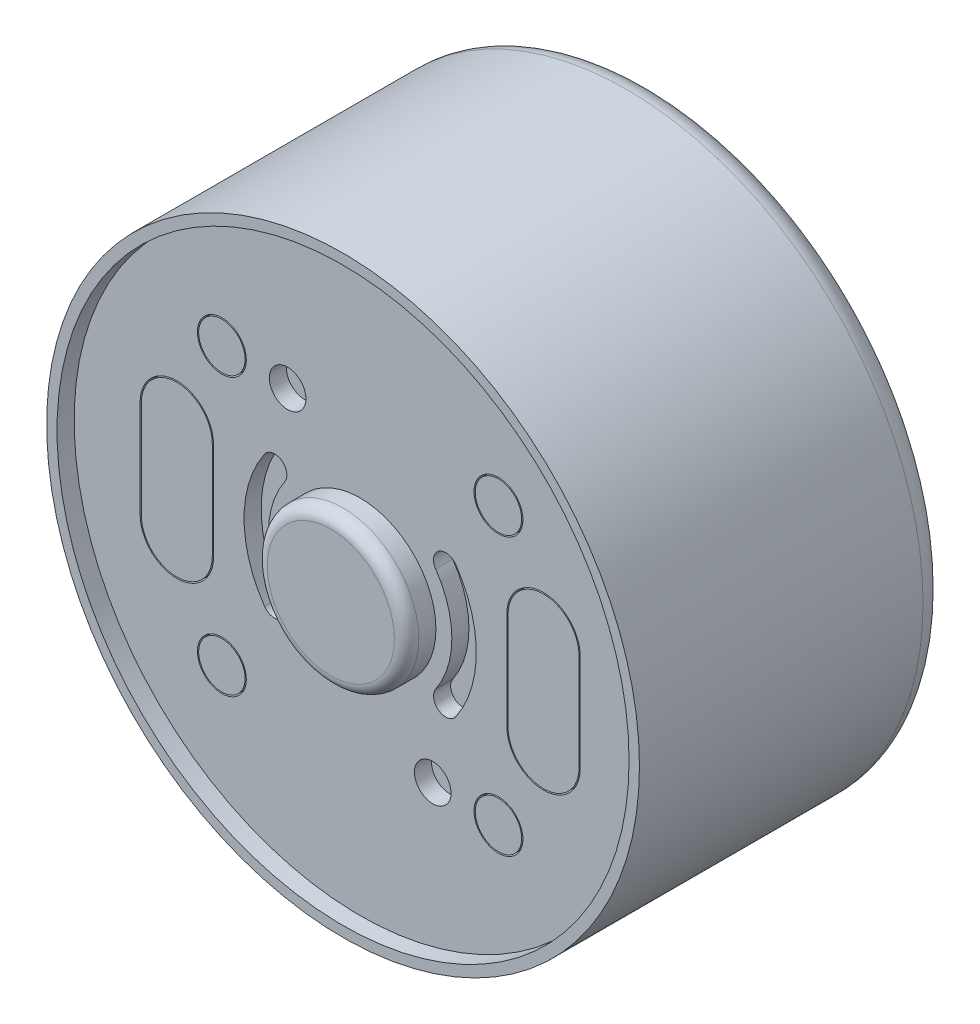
ISO-10303-21;
HEADER;
FILE_DESCRIPTION(('STEP AP214'),'2;1');
FILE_NAME('part.step','',(''),(''),'','','');
FILE_SCHEMA(('AUTOMOTIVE_DESIGN { 1 0 10303 214 1 1 1 1 }'));
ENDSEC;
DATA;
#1=APPLICATION_CONTEXT('core data for automotive mechanical design processes');
#2=APPLICATION_PROTOCOL_DEFINITION('international standard','automotive_design',2000,#1);
#3=PRODUCT_CONTEXT('',#1,'mechanical');
#4=PRODUCT('Part','Part','',(#3));
#5=PRODUCT_RELATED_PRODUCT_CATEGORY('part','',(#4));
#6=PRODUCT_DEFINITION_FORMATION('','',#4);
#7=PRODUCT_DEFINITION_CONTEXT('part definition',#1,'design');
#8=PRODUCT_DEFINITION('design','',#6,#7);
#9=PRODUCT_DEFINITION_SHAPE('','',#8);
#10=(LENGTH_UNIT() NAMED_UNIT(*) SI_UNIT(.MILLI.,.METRE.));
#11=(NAMED_UNIT(*) PLANE_ANGLE_UNIT() SI_UNIT($,.RADIAN.));
#12=(NAMED_UNIT(*) SI_UNIT($,.STERADIAN.) SOLID_ANGLE_UNIT());
#13=UNCERTAINTY_MEASURE_WITH_UNIT(LENGTH_MEASURE(1.E-05),#10,'distance_accuracy_value','');
#14=(GEOMETRIC_REPRESENTATION_CONTEXT(3) GLOBAL_UNCERTAINTY_ASSIGNED_CONTEXT((#13)) GLOBAL_UNIT_ASSIGNED_CONTEXT((#10,
#11,#12)) REPRESENTATION_CONTEXT('',''));
#15=CARTESIAN_POINT('',(0.,0.,0.));
#16=DIRECTION('',(0.,0.,1.));
#17=DIRECTION('',(1.,0.,0.));
#18=AXIS2_PLACEMENT_3D('',#15,#16,#17);
#19=CARTESIAN_POINT('',(0.,0.,-0.7));
#20=DIRECTION('',(0.,0.,1.));
#21=DIRECTION('',(1.,0.,0.));
#22=AXIS2_PLACEMENT_3D('',#19,#20,#21);
#23=PLANE('',#22);
#24=CARTESIAN_POINT('',(0.,0.,-0.7));
#25=DIRECTION('',(0.,0.,1.));
#26=DIRECTION('',(1.,0.,0.));
#27=AXIS2_PLACEMENT_3D('',#24,#25,#26);
#28=CIRCLE('',#27,11.7);
#29=CARTESIAN_POINT('',(11.7,0.,-0.7));
#30=VERTEX_POINT('',#29);
#31=EDGE_CURVE('E388',#30,#30,#28,.T.);
#32=ORIENTED_EDGE('',*,*,#31,.T.);
#33=EDGE_LOOP('',(#32));
#34=FACE_BOUND('',#33,.T.);
#35=CARTESIAN_POINT('',(0.,0.,-0.7));
#36=DIRECTION('',(0.,0.,1.));
#37=DIRECTION('',(1.,0.,0.));
#38=AXIS2_PLACEMENT_3D('',#35,#36,#37);
#39=CIRCLE('',#38,4.75);
#40=CARTESIAN_POINT('',(-3.91176470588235,2.69454947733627,-0.7));
#41=VERTEX_POINT('',#40);
#42=CARTESIAN_POINT('',(-3.91176470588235,-2.69454947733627,-0.7));
#43=VERTEX_POINT('',#42);
#44=EDGE_CURVE('E347',#41,#43,#39,.T.);
#45=ORIENTED_EDGE('',*,*,#44,.F.);
#46=CARTESIAN_POINT('',(-3.5,2.41091269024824,-0.7));
#47=DIRECTION('',(0.,0.,1.));
#48=DIRECTION('',(1.,0.,0.));
#49=AXIS2_PLACEMENT_3D('',#46,#47,#48);
#50=CIRCLE('',#49,0.5);
#51=CARTESIAN_POINT('',(-3.08823529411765,2.12727590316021,-0.7));
#52=VERTEX_POINT('',#51);
#53=EDGE_CURVE('E361',#52,#41,#50,.T.);
#54=ORIENTED_EDGE('',*,*,#53,.F.);
#55=CARTESIAN_POINT('',(0.,0.,-0.7));
#56=DIRECTION('',(0.,0.,-1.));
#57=DIRECTION('',(1.,0.,0.));
#58=AXIS2_PLACEMENT_3D('',#55,#56,#57);
#59=CIRCLE('',#58,3.75);
#60=CARTESIAN_POINT('',(-3.08823529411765,-2.12727590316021,-0.7));
#61=VERTEX_POINT('',#60);
#62=EDGE_CURVE('E358',#61,#52,#59,.T.);
#63=ORIENTED_EDGE('',*,*,#62,.F.);
#64=CARTESIAN_POINT('',(-3.5,-2.41091269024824,-0.7));
#65=DIRECTION('',(0.,0.,1.));
#66=DIRECTION('',(1.,0.,0.));
#67=AXIS2_PLACEMENT_3D('',#64,#65,#66);
#68=CIRCLE('',#67,0.5);
#69=EDGE_CURVE('E355',#43,#61,#68,.T.);
#70=ORIENTED_EDGE('',*,*,#69,.F.);
#71=EDGE_LOOP('',(#45,#54,#63,#70));
#72=FACE_BOUND('',#71,.T.);
#73=CARTESIAN_POINT('',(3.5,-2.41091269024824,-0.7));
#74=DIRECTION('',(0.,0.,1.));
#75=DIRECTION('',(1.,0.,0.));
#76=AXIS2_PLACEMENT_3D('',#73,#74,#75);
#77=CIRCLE('',#76,0.5);
#78=CARTESIAN_POINT('',(3.08823529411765,-2.12727590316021,-0.7));
#79=VERTEX_POINT('',#78);
#80=CARTESIAN_POINT('',(3.91176470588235,-2.69454947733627,-0.7));
#81=VERTEX_POINT('',#80);
#82=EDGE_CURVE('E315',#79,#81,#77,.T.);
#83=ORIENTED_EDGE('',*,*,#82,.F.);
#84=CARTESIAN_POINT('',(0.,0.,-0.7));
#85=DIRECTION('',(0.,0.,-1.));
#86=DIRECTION('',(1.,0.,0.));
#87=AXIS2_PLACEMENT_3D('',#84,#85,#86);
#88=CIRCLE('',#87,3.75);
#89=CARTESIAN_POINT('',(3.08823529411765,2.12727590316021,-0.7));
#90=VERTEX_POINT('',#89);
#91=EDGE_CURVE('E329',#90,#79,#88,.T.);
#92=ORIENTED_EDGE('',*,*,#91,.F.);
#93=CARTESIAN_POINT('',(3.5,2.41091269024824,-0.7));
#94=DIRECTION('',(0.,0.,1.));
#95=DIRECTION('',(1.,0.,0.));
#96=AXIS2_PLACEMENT_3D('',#93,#94,#95);
#97=CIRCLE('',#96,0.5);
#98=CARTESIAN_POINT('',(3.91176470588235,2.69454947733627,-0.7));
#99=VERTEX_POINT('',#98);
#100=EDGE_CURVE('E326',#99,#90,#97,.T.);
#101=ORIENTED_EDGE('',*,*,#100,.F.);
#102=CARTESIAN_POINT('',(0.,0.,-0.7));
#103=DIRECTION('',(0.,0.,1.));
#104=DIRECTION('',(1.,0.,0.));
#105=AXIS2_PLACEMENT_3D('',#102,#103,#104);
#106=CIRCLE('',#105,4.75);
#107=EDGE_CURVE('E323',#81,#99,#106,.T.);
#108=ORIENTED_EDGE('',*,*,#107,.F.);
#109=EDGE_LOOP('',(#83,#92,#101,#108));
#110=FACE_BOUND('',#109,.T.);
#111=CARTESIAN_POINT('',(7.5,-2.,-0.7));
#112=DIRECTION('',(0.,0.,1.));
#113=DIRECTION('',(-1.,0.,0.));
#114=AXIS2_PLACEMENT_3D('',#111,#112,#113);
#115=CIRCLE('',#114,1.5);
#116=CARTESIAN_POINT('',(6.,-2.,-0.7));
#117=VERTEX_POINT('',#116);
#118=CARTESIAN_POINT('',(9.,-2.,-0.7));
#119=VERTEX_POINT('',#118);
#120=EDGE_CURVE('E283',#117,#119,#115,.T.);
#121=ORIENTED_EDGE('',*,*,#120,.F.);
#122=DIRECTION('',(0.,-1.,0.));
#123=VECTOR('',#122,1.);
#124=CARTESIAN_POINT('',(6.,2.,-0.7));
#125=LINE('',#124,#123);
#126=CARTESIAN_POINT('',(6.,2.,-0.7));
#127=VERTEX_POINT('',#126);
#128=EDGE_CURVE('E297',#127,#117,#125,.T.);
#129=ORIENTED_EDGE('',*,*,#128,.F.);
#130=CARTESIAN_POINT('',(7.5,2.,-0.7));
#131=DIRECTION('',(0.,0.,1.));
#132=DIRECTION('',(-1.,0.,0.));
#133=AXIS2_PLACEMENT_3D('',#130,#131,#132);
#134=CIRCLE('',#133,1.5);
#135=CARTESIAN_POINT('',(9.,2.,-0.7));
#136=VERTEX_POINT('',#135);
#137=EDGE_CURVE('E294',#136,#127,#134,.T.);
#138=ORIENTED_EDGE('',*,*,#137,.F.);
#139=DIRECTION('',(0.,1.,0.));
#140=VECTOR('',#139,1.);
#141=CARTESIAN_POINT('',(9.,2.,-0.7));
#142=LINE('',#141,#140);
#143=EDGE_CURVE('E291',#119,#136,#142,.T.);
#144=ORIENTED_EDGE('',*,*,#143,.F.);
#145=EDGE_LOOP('',(#121,#129,#138,#144));
#146=FACE_BOUND('',#145,.T.);
#147=CARTESIAN_POINT('',(-7.5,2.,-0.7));
#148=DIRECTION('',(0.,0.,1.));
#149=DIRECTION('',(1.,0.,0.));
#150=AXIS2_PLACEMENT_3D('',#147,#148,#149);
#151=CIRCLE('',#150,1.5);
#152=CARTESIAN_POINT('',(-6.,2.,-0.7));
#153=VERTEX_POINT('',#152);
#154=CARTESIAN_POINT('',(-9.,2.,-0.7));
#155=VERTEX_POINT('',#154);
#156=EDGE_CURVE('E42',#153,#155,#151,.T.);
#157=ORIENTED_EDGE('',*,*,#156,.F.);
#158=DIRECTION('',(0.,1.,0.));
#159=VECTOR('',#158,1.);
#160=CARTESIAN_POINT('',(-6.,2.,-0.7));
#161=LINE('',#160,#159);
#162=CARTESIAN_POINT('',(-6.,-2.,-0.7));
#163=VERTEX_POINT('',#162);
#164=EDGE_CURVE('E233',#163,#153,#161,.T.);
#165=ORIENTED_EDGE('',*,*,#164,.F.);
#166=CARTESIAN_POINT('',(-7.5,-2.,-0.7));
#167=DIRECTION('',(0.,0.,1.));
#168=DIRECTION('',(1.,0.,0.));
#169=AXIS2_PLACEMENT_3D('',#166,#167,#168);
#170=CIRCLE('',#169,1.5);
#171=CARTESIAN_POINT('',(-9.,-2.,-0.7));
#172=VERTEX_POINT('',#171);
#173=EDGE_CURVE('E230',#172,#163,#170,.T.);
#174=ORIENTED_EDGE('',*,*,#173,.F.);
#175=DIRECTION('',(0.,-1.,0.));
#176=VECTOR('',#175,1.);
#177=CARTESIAN_POINT('',(-9.,2.,-0.7));
#178=LINE('',#177,#176);
#179=EDGE_CURVE('E227',#155,#172,#178,.T.);
#180=ORIENTED_EDGE('',*,*,#179,.F.);
#181=EDGE_LOOP('',(#157,#165,#174,#180));
#182=FACE_BOUND('',#181,.T.);
#183=CARTESIAN_POINT('',(-2.96858552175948,5.5,-0.7));
#184=DIRECTION('',(0.,0.,1.));
#185=DIRECTION('',(1.,0.,0.));
#186=AXIS2_PLACEMENT_3D('',#183,#184,#185);
#187=CIRCLE('',#186,0.75);
#188=CARTESIAN_POINT('',(-2.21858552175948,5.5,-0.7));
#189=VERTEX_POINT('',#188);
#190=EDGE_CURVE('E576',#189,#189,#187,.T.);
#191=ORIENTED_EDGE('',*,*,#190,.F.);
#192=EDGE_LOOP('',(#191));
#193=FACE_BOUND('',#192,.T.);
#194=CARTESIAN_POINT('',(2.96858552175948,-5.5,-0.7));
#195=DIRECTION('',(0.,0.,1.));
#196=DIRECTION('',(1.,0.,0.));
#197=AXIS2_PLACEMENT_3D('',#194,#195,#196);
#198=CIRCLE('',#197,0.75);
#199=CARTESIAN_POINT('',(3.71858552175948,-5.5,-0.7));
#200=VERTEX_POINT('',#199);
#201=EDGE_CURVE('E570',#200,#200,#198,.T.);
#202=ORIENTED_EDGE('',*,*,#201,.F.);
#203=EDGE_LOOP('',(#202));
#204=FACE_BOUND('',#203,.T.);
#205=CARTESIAN_POINT('',(-5.65685424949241,5.65685424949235,-0.7));
#206=DIRECTION('',(0.,0.,1.));
#207=DIRECTION('',(1.,0.,0.));
#208=AXIS2_PLACEMENT_3D('',#205,#206,#207);
#209=CIRCLE('',#208,1.);
#210=CARTESIAN_POINT('',(-4.65685424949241,5.65685424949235,-0.7));
#211=VERTEX_POINT('',#210);
#212=EDGE_CURVE('E564',#211,#211,#209,.T.);
#213=ORIENTED_EDGE('',*,*,#212,.F.);
#214=EDGE_LOOP('',(#213));
#215=FACE_BOUND('',#214,.T.);
#216=CARTESIAN_POINT('',(-5.65685424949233,-5.65685424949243,-0.7));
#217=DIRECTION('',(0.,0.,1.));
#218=DIRECTION('',(1.,0.,0.));
#219=AXIS2_PLACEMENT_3D('',#216,#217,#218);
#220=CIRCLE('',#219,1.);
#221=CARTESIAN_POINT('',(-4.65685424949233,-5.65685424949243,-0.7));
#222=VERTEX_POINT('',#221);
#223=EDGE_CURVE('E553',#222,#222,#220,.T.);
#224=ORIENTED_EDGE('',*,*,#223,.F.);
#225=EDGE_LOOP('',(#224));
#226=FACE_BOUND('',#225,.T.);
#227=CARTESIAN_POINT('',(5.65685424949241,-5.65685424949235,-0.7));
#228=DIRECTION('',(0.,0.,1.));
#229=DIRECTION('',(1.,0.,0.));
#230=AXIS2_PLACEMENT_3D('',#227,#228,#229);
#231=CIRCLE('',#230,1.);
#232=CARTESIAN_POINT('',(6.65685424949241,-5.65685424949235,-0.7));
#233=VERTEX_POINT('',#232);
#234=EDGE_CURVE('E536',#233,#233,#231,.T.);
#235=ORIENTED_EDGE('',*,*,#234,.F.);
#236=EDGE_LOOP('',(#235));
#237=FACE_BOUND('',#236,.T.);
#238=CARTESIAN_POINT('',(5.65685424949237,5.65685424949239,-0.7));
#239=DIRECTION('',(0.,0.,1.));
#240=DIRECTION('',(1.,0.,0.));
#241=AXIS2_PLACEMENT_3D('',#238,#239,#240);
#242=CIRCLE('',#241,1.);
#243=CARTESIAN_POINT('',(6.65685424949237,5.65685424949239,-0.7));
#244=VERTEX_POINT('',#243);
#245=EDGE_CURVE('E539',#244,#244,#242,.T.);
#246=ORIENTED_EDGE('',*,*,#245,.F.);
#247=EDGE_LOOP('',(#246));
#248=FACE_BOUND('',#247,.T.);
#249=CARTESIAN_POINT('',(0.,0.,-0.7));
#250=DIRECTION('',(0.,0.,1.));
#251=DIRECTION('',(1.,0.,0.));
#252=AXIS2_PLACEMENT_3D('',#249,#250,#251);
#253=CIRCLE('',#252,3.1);
#254=CARTESIAN_POINT('',(3.1,0.,-0.7));
#255=VERTEX_POINT('',#254);
#256=EDGE_CURVE('E619',#255,#255,#253,.T.);
#257=ORIENTED_EDGE('',*,*,#256,.F.);
#258=EDGE_LOOP('',(#257));
#259=FACE_BOUND('',#258,.T.);
#260=ADVANCED_FACE('F27',(#34,#72,#110,#146,#182,#193,#204,#215,#226,#237,#248,#259),#23,.T.);
#261=CARTESIAN_POINT('',(0.,0.,-12.6));
#262=DIRECTION('',(0.,0.,1.));
#263=DIRECTION('',(1.,0.,0.));
#264=AXIS2_PLACEMENT_3D('',#261,#262,#263);
#265=PLANE('',#264);
#266=CARTESIAN_POINT('',(0.,0.,-12.6));
#267=DIRECTION('',(0.,0.,1.));
#268=DIRECTION('',(1.,0.,0.));
#269=AXIS2_PLACEMENT_3D('',#266,#267,#268);
#270=CIRCLE('',#269,11.125);
#271=CARTESIAN_POINT('',(11.125,0.,-12.6));
#272=VERTEX_POINT('',#271);
#273=EDGE_CURVE('E413',#272,#272,#270,.F.);
#274=ORIENTED_EDGE('',*,*,#273,.T.);
#275=EDGE_LOOP('',(#274));
#276=FACE_BOUND('',#275,.T.);
#277=CARTESIAN_POINT('',(0.,0.,-12.6));
#278=DIRECTION('',(0.,0.,1.));
#279=DIRECTION('',(1.,0.,0.));
#280=AXIS2_PLACEMENT_3D('',#277,#278,#279);
#281=CIRCLE('',#280,3.25);
#282=CARTESIAN_POINT('',(3.25,0.,-12.6));
#283=VERTEX_POINT('',#282);
#284=EDGE_CURVE('E422',#283,#283,#281,.F.);
#285=ORIENTED_EDGE('',*,*,#284,.F.);
#286=EDGE_LOOP('',(#285));
#287=FACE_BOUND('',#286,.T.);
#288=ADVANCED_FACE('F442',(#276,#287),#265,.F.);
#289=CARTESIAN_POINT('',(0.,0.,-12.6));
#290=DIRECTION('',(0.,0.,1.));
#291=DIRECTION('',(1.,0.,0.));
#292=AXIS2_PLACEMENT_3D('',#289,#290,#291);
#293=CYLINDRICAL_SURFACE('',#292,12.125);
#294=CARTESIAN_POINT('',(0.,0.,-11.6));
#295=DIRECTION('',(0.,0.,1.));
#296=DIRECTION('',(1.,0.,0.));
#297=AXIS2_PLACEMENT_3D('',#294,#295,#296);
#298=CIRCLE('',#297,12.125);
#299=CARTESIAN_POINT('',(12.125,0.,-11.6));
#300=VERTEX_POINT('',#299);
#301=EDGE_CURVE('E410',#300,#300,#298,.T.);
#302=ORIENTED_EDGE('',*,*,#301,.T.);
#303=EDGE_LOOP('',(#302));
#304=FACE_BOUND('',#303,.T.);
#305=CARTESIAN_POINT('',(0.,0.,0.));
#306=DIRECTION('',(0.,0.,1.));
#307=DIRECTION('',(1.,0.,0.));
#308=AXIS2_PLACEMENT_3D('',#305,#306,#307);
#309=CIRCLE('',#308,12.125);
#310=CARTESIAN_POINT('',(12.125,0.,0.));
#311=VERTEX_POINT('',#310);
#312=EDGE_CURVE('E407',#311,#311,#309,.T.);
#313=ORIENTED_EDGE('',*,*,#312,.F.);
#314=EDGE_LOOP('',(#313));
#315=FACE_BOUND('',#314,.T.);
#316=ADVANCED_FACE('F29',(#304,#315),#293,.T.);
#317=CARTESIAN_POINT('',(0.,0.,0.));
#318=DIRECTION('',(0.,0.,1.));
#319=DIRECTION('',(1.,0.,0.));
#320=AXIS2_PLACEMENT_3D('',#317,#318,#319);
#321=PLANE('',#320);
#322=CARTESIAN_POINT('',(0.,0.,0.));
#323=DIRECTION('',(0.,0.,1.));
#324=DIRECTION('',(1.,0.,0.));
#325=AXIS2_PLACEMENT_3D('',#322,#323,#324);
#326=CIRCLE('',#325,11.7);
#327=CARTESIAN_POINT('',(11.7,0.,0.));
#328=VERTEX_POINT('',#327);
#329=EDGE_CURVE('E379',#328,#328,#326,.T.);
#330=ORIENTED_EDGE('',*,*,#329,.F.);
#331=EDGE_LOOP('',(#330));
#332=FACE_BOUND('',#331,.T.);
#333=ORIENTED_EDGE('',*,*,#312,.T.);
#334=EDGE_LOOP('',(#333));
#335=FACE_BOUND('',#334,.T.);
#336=ADVANCED_FACE('F818',(#332,#335),#321,.T.);
#337=CARTESIAN_POINT('',(0.,0.,-11.6));
#338=DIRECTION('',(0.,0.,1.));
#339=DIRECTION('',(1.,0.,0.));
#340=AXIS2_PLACEMENT_3D('',#337,#338,#339);
#341=TOROIDAL_SURFACE('',#340,11.125,1.);
#342=ORIENTED_EDGE('',*,*,#273,.F.);
#343=EDGE_LOOP('',(#342));
#344=FACE_BOUND('',#343,.T.);
#345=ORIENTED_EDGE('',*,*,#301,.F.);
#346=EDGE_LOOP('',(#345));
#347=FACE_BOUND('',#346,.T.);
#348=ADVANCED_FACE('F807',(#344,#347),#341,.T.);
#349=CARTESIAN_POINT('',(0.,0.,-13.1));
#350=DIRECTION('',(0.,0.,-1.));
#351=DIRECTION('',(-1.,0.,0.));
#352=AXIS2_PLACEMENT_3D('',#349,#350,#351);
#353=PLANE('',#352);
#354=CARTESIAN_POINT('',(0.,0.,-13.1));
#355=DIRECTION('',(0.,0.,-1.));
#356=DIRECTION('',(-1.,0.,0.));
#357=AXIS2_PLACEMENT_3D('',#354,#355,#356);
#358=CIRCLE('',#357,2.5);
#359=CARTESIAN_POINT('',(-2.5,0.,-13.1));
#360=VERTEX_POINT('',#359);
#361=EDGE_CURVE('E397',#360,#360,#358,.T.);
#362=ORIENTED_EDGE('',*,*,#361,.F.);
#363=EDGE_LOOP('',(#362));
#364=FACE_BOUND('',#363,.T.);
#365=CARTESIAN_POINT('',(0.,0.,-13.1));
#366=DIRECTION('',(0.,0.,-1.));
#367=DIRECTION('',(-1.,0.,0.));
#368=AXIS2_PLACEMENT_3D('',#365,#366,#367);
#369=CIRCLE('',#368,3.25);
#370=CARTESIAN_POINT('',(-3.25,0.,-13.1));
#371=VERTEX_POINT('',#370);
#372=EDGE_CURVE('E403',#371,#371,#369,.T.);
#373=ORIENTED_EDGE('',*,*,#372,.T.);
#374=EDGE_LOOP('',(#373));
#375=FACE_BOUND('',#374,.T.);
#376=ADVANCED_FACE('F788',(#364,#375),#353,.T.);
#377=CARTESIAN_POINT('',(0.,0.,-13.1));
#378=DIRECTION('',(0.,0.,1.));
#379=DIRECTION('',(1.,0.,0.));
#380=AXIS2_PLACEMENT_3D('',#377,#378,#379);
#381=CYLINDRICAL_SURFACE('',#380,3.25);
#382=ORIENTED_EDGE('',*,*,#372,.F.);
#383=EDGE_LOOP('',(#382));
#384=FACE_BOUND('',#383,.T.);
#385=ORIENTED_EDGE('',*,*,#284,.T.);
#386=EDGE_LOOP('',(#385));
#387=FACE_BOUND('',#386,.T.);
#388=ADVANCED_FACE('F803',(#384,#387),#381,.T.);
#389=CARTESIAN_POINT('',(0.,0.,-13.));
#390=DIRECTION('',(0.,0.,-1.));
#391=DIRECTION('',(-1.,0.,0.));
#392=AXIS2_PLACEMENT_3D('',#389,#390,#391);
#393=CYLINDRICAL_SURFACE('',#392,2.5);
#394=CARTESIAN_POINT('',(0.,0.,-13.));
#395=DIRECTION('',(0.,0.,-1.));
#396=DIRECTION('',(-1.,0.,0.));
#397=AXIS2_PLACEMENT_3D('',#394,#395,#396);
#398=CIRCLE('',#397,2.5);
#399=CARTESIAN_POINT('',(-2.5,0.,-13.));
#400=VERTEX_POINT('',#399);
#401=EDGE_CURVE('E400',#400,#400,#398,.T.);
#402=ORIENTED_EDGE('',*,*,#401,.F.);
#403=EDGE_LOOP('',(#402));
#404=FACE_BOUND('',#403,.T.);
#405=ORIENTED_EDGE('',*,*,#361,.T.);
#406=EDGE_LOOP('',(#405));
#407=FACE_BOUND('',#406,.T.);
#408=ADVANCED_FACE('F800',(#404,#407),#393,.F.);
#409=CARTESIAN_POINT('',(0.,0.,-13.));
#410=DIRECTION('',(0.,0.,-1.));
#411=DIRECTION('',(-1.,0.,0.));
#412=AXIS2_PLACEMENT_3D('',#409,#410,#411);
#413=PLANE('',#412);
#414=CARTESIAN_POINT('',(0.,0.,-13.));
#415=DIRECTION('',(0.,0.,-1.));
#416=DIRECTION('',(-1.,0.,0.));
#417=AXIS2_PLACEMENT_3D('',#414,#415,#416);
#418=CIRCLE('',#417,2.45);
#419=CARTESIAN_POINT('',(-2.45,0.,-13.));
#420=VERTEX_POINT('',#419);
#421=EDGE_CURVE('E394',#420,#420,#418,.T.);
#422=ORIENTED_EDGE('',*,*,#421,.F.);
#423=EDGE_LOOP('',(#422));
#424=FACE_BOUND('',#423,.T.);
#425=ORIENTED_EDGE('',*,*,#401,.T.);
#426=EDGE_LOOP('',(#425));
#427=FACE_BOUND('',#426,.T.);
#428=ADVANCED_FACE('F796',(#424,#427),#413,.T.);
#429=CARTESIAN_POINT('',(0.,0.,-13.));
#430=DIRECTION('',(0.,0.,-1.));
#431=DIRECTION('',(-1.,0.,0.));
#432=AXIS2_PLACEMENT_3D('',#429,#430,#431);
#433=CYLINDRICAL_SURFACE('',#432,2.45);
#434=ORIENTED_EDGE('',*,*,#421,.T.);
#435=EDGE_LOOP('',(#434));
#436=FACE_BOUND('',#435,.T.);
#437=CARTESIAN_POINT('',(0.,0.,-13.1));
#438=DIRECTION('',(0.,0.,-1.));
#439=DIRECTION('',(-1.,0.,0.));
#440=AXIS2_PLACEMENT_3D('',#437,#438,#439);
#441=CIRCLE('',#440,2.45);
#442=CARTESIAN_POINT('',(-2.45,0.,-13.1));
#443=VERTEX_POINT('',#442);
#444=EDGE_CURVE('E391',#443,#443,#441,.T.);
#445=ORIENTED_EDGE('',*,*,#444,.F.);
#446=EDGE_LOOP('',(#445));
#447=FACE_BOUND('',#446,.T.);
#448=ADVANCED_FACE('F792',(#436,#447),#433,.T.);
#449=CARTESIAN_POINT('',(0.,0.,-19.6));
#450=DIRECTION('',(0.,0.,-1.));
#451=DIRECTION('',(-1.,0.,0.));
#452=AXIS2_PLACEMENT_3D('',#449,#450,#451);
#453=PLANE('',#452);
#454=CARTESIAN_POINT('',(0.,0.,-19.6));
#455=DIRECTION('',(0.,0.,-1.));
#456=DIRECTION('',(-1.,0.,0.));
#457=AXIS2_PLACEMENT_3D('',#454,#455,#456);
#458=CIRCLE('',#457,0.8);
#459=CARTESIAN_POINT('',(-0.8,0.,-19.6));
#460=VERTEX_POINT('',#459);
#461=EDGE_CURVE('E416',#460,#460,#458,.T.);
#462=ORIENTED_EDGE('',*,*,#461,.T.);
#463=EDGE_LOOP('',(#462));
#464=FACE_BOUND('',#463,.T.);
#465=ADVANCED_FACE('F795',(#464),#453,.T.);
#466=CARTESIAN_POINT('',(0.,0.,-19.4));
#467=DIRECTION('',(0.,0.,-1.));
#468=DIRECTION('',(-1.,0.,0.));
#469=AXIS2_PLACEMENT_3D('',#466,#467,#468);
#470=TOROIDAL_SURFACE('',#469,0.8,0.2);
#471=CARTESIAN_POINT('',(0.,0.,-19.4));
#472=DIRECTION('',(0.,0.,-1.));
#473=DIRECTION('',(-1.,0.,0.));
#474=AXIS2_PLACEMENT_3D('',#471,#472,#473);
#475=CIRCLE('',#474,1.);
#476=CARTESIAN_POINT('',(-1.,0.,-19.4));
#477=VERTEX_POINT('',#476);
#478=EDGE_CURVE('E419',#477,#477,#475,.F.);
#479=ORIENTED_EDGE('',*,*,#478,.F.);
#480=EDGE_LOOP('',(#479));
#481=FACE_BOUND('',#480,.T.);
#482=ORIENTED_EDGE('',*,*,#461,.F.);
#483=EDGE_LOOP('',(#482));
#484=FACE_BOUND('',#483,.T.);
#485=ADVANCED_FACE('F812',(#481,#484),#470,.T.);
#486=CARTESIAN_POINT('',(0.,0.,-19.6));
#487=DIRECTION('',(0.,0.,1.));
#488=DIRECTION('',(1.,0.,0.));
#489=AXIS2_PLACEMENT_3D('',#486,#487,#488);
#490=CYLINDRICAL_SURFACE('',#489,1.);
#491=CARTESIAN_POINT('',(0.,0.,-13.1));
#492=DIRECTION('',(0.,0.,-1.));
#493=DIRECTION('',(-1.,0.,0.));
#494=AXIS2_PLACEMENT_3D('',#491,#492,#493);
#495=CIRCLE('',#494,1.);
#496=CARTESIAN_POINT('',(-1.,0.,-13.1));
#497=VERTEX_POINT('',#496);
#498=EDGE_CURVE('E406',#497,#497,#495,.T.);
#499=ORIENTED_EDGE('',*,*,#498,.T.);
#500=EDGE_LOOP('',(#499));
#501=FACE_BOUND('',#500,.T.);
#502=ORIENTED_EDGE('',*,*,#478,.T.);
#503=EDGE_LOOP('',(#502));
#504=FACE_BOUND('',#503,.T.);
#505=ADVANCED_FACE('F785',(#501,#504),#490,.T.);
#506=ORIENTED_EDGE('',*,*,#498,.F.);
#507=EDGE_LOOP('',(#506));
#508=FACE_BOUND('',#507,.T.);
#509=ORIENTED_EDGE('',*,*,#444,.T.);
#510=EDGE_LOOP('',(#509));
#511=FACE_BOUND('',#510,.T.);
#512=ADVANCED_FACE('F752',(#508,#511),#353,.T.);
#513=CARTESIAN_POINT('',(0.,0.,-0.7));
#514=DIRECTION('',(0.,0.,1.));
#515=DIRECTION('',(1.,0.,0.));
#516=AXIS2_PLACEMENT_3D('',#513,#514,#515);
#517=CYLINDRICAL_SURFACE('',#516,11.7);
#518=ORIENTED_EDGE('',*,*,#31,.F.);
#519=EDGE_LOOP('',(#518));
#520=FACE_BOUND('',#519,.T.);
#521=ORIENTED_EDGE('',*,*,#329,.T.);
#522=EDGE_LOOP('',(#521));
#523=FACE_BOUND('',#522,.T.);
#524=ADVANCED_FACE('F747',(#520,#523),#517,.F.);
#525=CARTESIAN_POINT('',(0.,0.,-1.4));
#526=DIRECTION('',(0.,0.,1.));
#527=DIRECTION('',(1.,0.,0.));
#528=AXIS2_PLACEMENT_3D('',#525,#526,#527);
#529=CYLINDRICAL_SURFACE('',#528,4.75);
#530=ORIENTED_EDGE('',*,*,#44,.T.);
#531=DIRECTION('',(0.,0.,1.));
#532=VECTOR('',#531,1.);
#533=CARTESIAN_POINT('',(-3.91176470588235,-2.69454947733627,-1.4));
#534=LINE('',#533,#532);
#535=CARTESIAN_POINT('',(-3.91176470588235,-2.69454947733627,-1.4));
#536=VERTEX_POINT('',#535);
#537=EDGE_CURVE('E376',#536,#43,#534,.T.);
#538=ORIENTED_EDGE('',*,*,#537,.F.);
#539=CARTESIAN_POINT('',(0.,0.,-1.4));
#540=DIRECTION('',(0.,0.,1.));
#541=DIRECTION('',(1.,0.,0.));
#542=AXIS2_PLACEMENT_3D('',#539,#540,#541);
#543=CIRCLE('',#542,4.75);
#544=CARTESIAN_POINT('',(-3.91176470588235,2.69454947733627,-1.4));
#545=VERTEX_POINT('',#544);
#546=EDGE_CURVE('E364',#545,#536,#543,.T.);
#547=ORIENTED_EDGE('',*,*,#546,.F.);
#548=DIRECTION('',(0.,0.,1.));
#549=VECTOR('',#548,1.);
#550=CARTESIAN_POINT('',(-3.91176470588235,2.69454947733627,-1.4));
#551=LINE('',#550,#549);
#552=EDGE_CURVE('E377',#545,#41,#551,.T.);
#553=ORIENTED_EDGE('',*,*,#552,.T.);
#554=EDGE_LOOP('',(#530,#538,#547,#553));
#555=FACE_BOUND('',#554,.T.);
#556=ADVANCED_FACE('F739',(#555),#529,.F.);
#557=CARTESIAN_POINT('',(-3.5,2.41091269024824,-1.4));
#558=DIRECTION('',(0.,0.,1.));
#559=DIRECTION('',(1.,0.,0.));
#560=AXIS2_PLACEMENT_3D('',#557,#558,#559);
#561=CYLINDRICAL_SURFACE('',#560,0.5);
#562=ORIENTED_EDGE('',*,*,#53,.T.);
#563=ORIENTED_EDGE('',*,*,#552,.F.);
#564=CARTESIAN_POINT('',(-3.5,2.41091269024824,-1.4));
#565=DIRECTION('',(0.,0.,1.));
#566=DIRECTION('',(1.,0.,0.));
#567=AXIS2_PLACEMENT_3D('',#564,#565,#566);
#568=CIRCLE('',#567,0.5);
#569=CARTESIAN_POINT('',(-3.08823529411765,2.12727590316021,-1.4));
#570=VERTEX_POINT('',#569);
#571=EDGE_CURVE('E373',#570,#545,#568,.T.);
#572=ORIENTED_EDGE('',*,*,#571,.F.);
#573=DIRECTION('',(0.,0.,1.));
#574=VECTOR('',#573,1.);
#575=CARTESIAN_POINT('',(-3.08823529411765,2.12727590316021,-1.4));
#576=LINE('',#575,#574);
#577=EDGE_CURVE('E380',#570,#52,#576,.T.);
#578=ORIENTED_EDGE('',*,*,#577,.T.);
#579=EDGE_LOOP('',(#562,#563,#572,#578));
#580=FACE_BOUND('',#579,.T.);
#581=ADVANCED_FACE('F735',(#580),#561,.F.);
#582=CARTESIAN_POINT('',(0.,0.,-1.4));
#583=DIRECTION('',(0.,0.,1.));
#584=DIRECTION('',(1.,0.,0.));
#585=AXIS2_PLACEMENT_3D('',#582,#583,#584);
#586=CYLINDRICAL_SURFACE('',#585,3.75);
#587=ORIENTED_EDGE('',*,*,#62,.T.);
#588=ORIENTED_EDGE('',*,*,#577,.F.);
#589=CARTESIAN_POINT('',(0.,0.,-1.4));
#590=DIRECTION('',(0.,0.,-1.));
#591=DIRECTION('',(1.,0.,0.));
#592=AXIS2_PLACEMENT_3D('',#589,#590,#591);
#593=CIRCLE('',#592,3.75);
#594=CARTESIAN_POINT('',(-3.08823529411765,-2.12727590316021,-1.4));
#595=VERTEX_POINT('',#594);
#596=EDGE_CURVE('E370',#595,#570,#593,.T.);
#597=ORIENTED_EDGE('',*,*,#596,.F.);
#598=DIRECTION('',(0.,0.,1.));
#599=VECTOR('',#598,1.);
#600=CARTESIAN_POINT('',(-3.08823529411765,-2.12727590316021,-1.4));
#601=LINE('',#600,#599);
#602=EDGE_CURVE('E382',#595,#61,#601,.T.);
#603=ORIENTED_EDGE('',*,*,#602,.T.);
#604=EDGE_LOOP('',(#587,#588,#597,#603));
#605=FACE_BOUND('',#604,.T.);
#606=ADVANCED_FACE('F738',(#605),#586,.T.);
#607=CARTESIAN_POINT('',(-3.5,-2.41091269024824,-1.4));
#608=DIRECTION('',(0.,0.,1.));
#609=DIRECTION('',(1.,0.,0.));
#610=AXIS2_PLACEMENT_3D('',#607,#608,#609);
#611=CYLINDRICAL_SURFACE('',#610,0.5);
#612=ORIENTED_EDGE('',*,*,#69,.T.);
#613=ORIENTED_EDGE('',*,*,#602,.F.);
#614=CARTESIAN_POINT('',(-3.5,-2.41091269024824,-1.4));
#615=DIRECTION('',(0.,0.,1.));
#616=DIRECTION('',(1.,0.,0.));
#617=AXIS2_PLACEMENT_3D('',#614,#615,#616);
#618=CIRCLE('',#617,0.5);
#619=EDGE_CURVE('E367',#536,#595,#618,.T.);
#620=ORIENTED_EDGE('',*,*,#619,.F.);
#621=ORIENTED_EDGE('',*,*,#537,.T.);
#622=EDGE_LOOP('',(#612,#613,#620,#621));
#623=FACE_BOUND('',#622,.T.);
#624=ADVANCED_FACE('F733',(#623),#611,.F.);
#625=CARTESIAN_POINT('',(-1.75,-1.20545634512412,-1.4));
#626=DIRECTION('',(0.,0.,1.));
#627=DIRECTION('',(1.,0.,0.));
#628=AXIS2_PLACEMENT_3D('',#625,#626,#627);
#629=PLANE('',#628);
#630=ORIENTED_EDGE('',*,*,#546,.T.);
#631=ORIENTED_EDGE('',*,*,#619,.T.);
#632=ORIENTED_EDGE('',*,*,#596,.T.);
#633=ORIENTED_EDGE('',*,*,#571,.T.);
#634=EDGE_LOOP('',(#630,#631,#632,#633));
#635=FACE_BOUND('',#634,.T.);
#636=ADVANCED_FACE('F729',(#635),#629,.T.);
#637=CARTESIAN_POINT('',(3.5,-2.41091269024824,-1.4));
#638=DIRECTION('',(0.,0.,1.));
#639=DIRECTION('',(1.,0.,0.));
#640=AXIS2_PLACEMENT_3D('',#637,#638,#639);
#641=CYLINDRICAL_SURFACE('',#640,0.5);
#642=ORIENTED_EDGE('',*,*,#82,.T.);
#643=DIRECTION('',(0.,0.,1.));
#644=VECTOR('',#643,1.);
#645=CARTESIAN_POINT('',(3.91176470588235,-2.69454947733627,-1.4));
#646=LINE('',#645,#644);
#647=CARTESIAN_POINT('',(3.91176470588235,-2.69454947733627,-1.4));
#648=VERTEX_POINT('',#647);
#649=EDGE_CURVE('E344',#648,#81,#646,.T.);
#650=ORIENTED_EDGE('',*,*,#649,.F.);
#651=CARTESIAN_POINT('',(3.5,-2.41091269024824,-1.4));
#652=DIRECTION('',(0.,0.,1.));
#653=DIRECTION('',(1.,0.,0.));
#654=AXIS2_PLACEMENT_3D('',#651,#652,#653);
#655=CIRCLE('',#654,0.5);
#656=CARTESIAN_POINT('',(3.08823529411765,-2.12727590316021,-1.4));
#657=VERTEX_POINT('',#656);
#658=EDGE_CURVE('E332',#657,#648,#655,.T.);
#659=ORIENTED_EDGE('',*,*,#658,.F.);
#660=DIRECTION('',(0.,0.,1.));
#661=VECTOR('',#660,1.);
#662=CARTESIAN_POINT('',(3.08823529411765,-2.12727590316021,-1.4));
#663=LINE('',#662,#661);
#664=EDGE_CURVE('E345',#657,#79,#663,.T.);
#665=ORIENTED_EDGE('',*,*,#664,.T.);
#666=EDGE_LOOP('',(#642,#650,#659,#665));
#667=FACE_BOUND('',#666,.T.);
#668=ADVANCED_FACE('F719',(#667),#641,.F.);
#669=CARTESIAN_POINT('',(0.,0.,-1.4));
#670=DIRECTION('',(0.,0.,1.));
#671=DIRECTION('',(1.,0.,0.));
#672=AXIS2_PLACEMENT_3D('',#669,#670,#671);
#673=CYLINDRICAL_SURFACE('',#672,3.75);
#674=ORIENTED_EDGE('',*,*,#91,.T.);
#675=ORIENTED_EDGE('',*,*,#664,.F.);
#676=CARTESIAN_POINT('',(0.,0.,-1.4));
#677=DIRECTION('',(0.,0.,-1.));
#678=DIRECTION('',(1.,0.,0.));
#679=AXIS2_PLACEMENT_3D('',#676,#677,#678);
#680=CIRCLE('',#679,3.75);
#681=CARTESIAN_POINT('',(3.08823529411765,2.12727590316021,-1.4));
#682=VERTEX_POINT('',#681);
#683=EDGE_CURVE('E341',#682,#657,#680,.T.);
#684=ORIENTED_EDGE('',*,*,#683,.F.);
#685=DIRECTION('',(0.,0.,1.));
#686=VECTOR('',#685,1.);
#687=CARTESIAN_POINT('',(3.08823529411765,2.12727590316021,-1.4));
#688=LINE('',#687,#686);
#689=EDGE_CURVE('E348',#682,#90,#688,.T.);
#690=ORIENTED_EDGE('',*,*,#689,.T.);
#691=EDGE_LOOP('',(#674,#675,#684,#690));
#692=FACE_BOUND('',#691,.T.);
#693=ADVANCED_FACE('F715',(#692),#673,.T.);
#694=CARTESIAN_POINT('',(3.5,2.41091269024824,-1.4));
#695=DIRECTION('',(0.,0.,1.));
#696=DIRECTION('',(1.,0.,0.));
#697=AXIS2_PLACEMENT_3D('',#694,#695,#696);
#698=CYLINDRICAL_SURFACE('',#697,0.5);
#699=ORIENTED_EDGE('',*,*,#100,.T.);
#700=ORIENTED_EDGE('',*,*,#689,.F.);
#701=CARTESIAN_POINT('',(3.5,2.41091269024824,-1.4));
#702=DIRECTION('',(0.,0.,1.));
#703=DIRECTION('',(1.,0.,0.));
#704=AXIS2_PLACEMENT_3D('',#701,#702,#703);
#705=CIRCLE('',#704,0.5);
#706=CARTESIAN_POINT('',(3.91176470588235,2.69454947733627,-1.4));
#707=VERTEX_POINT('',#706);
#708=EDGE_CURVE('E338',#707,#682,#705,.T.);
#709=ORIENTED_EDGE('',*,*,#708,.F.);
#710=DIRECTION('',(0.,0.,1.));
#711=VECTOR('',#710,1.);
#712=CARTESIAN_POINT('',(3.91176470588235,2.69454947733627,-1.4));
#713=LINE('',#712,#711);
#714=EDGE_CURVE('E350',#707,#99,#713,.T.);
#715=ORIENTED_EDGE('',*,*,#714,.T.);
#716=EDGE_LOOP('',(#699,#700,#709,#715));
#717=FACE_BOUND('',#716,.T.);
#718=ADVANCED_FACE('F718',(#717),#698,.F.);
#719=CARTESIAN_POINT('',(0.,0.,-1.4));
#720=DIRECTION('',(0.,0.,1.));
#721=DIRECTION('',(1.,0.,0.));
#722=AXIS2_PLACEMENT_3D('',#719,#720,#721);
#723=CYLINDRICAL_SURFACE('',#722,4.75);
#724=ORIENTED_EDGE('',*,*,#107,.T.);
#725=ORIENTED_EDGE('',*,*,#714,.F.);
#726=CARTESIAN_POINT('',(0.,0.,-1.4));
#727=DIRECTION('',(0.,0.,1.));
#728=DIRECTION('',(1.,0.,0.));
#729=AXIS2_PLACEMENT_3D('',#726,#727,#728);
#730=CIRCLE('',#729,4.75);
#731=EDGE_CURVE('E335',#648,#707,#730,.T.);
#732=ORIENTED_EDGE('',*,*,#731,.F.);
#733=ORIENTED_EDGE('',*,*,#649,.T.);
#734=EDGE_LOOP('',(#724,#725,#732,#733));
#735=FACE_BOUND('',#734,.T.);
#736=ADVANCED_FACE('F713',(#735),#723,.F.);
#737=CARTESIAN_POINT('',(1.75,-1.20545634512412,-1.4));
#738=DIRECTION('',(0.,0.,1.));
#739=DIRECTION('',(1.,0.,0.));
#740=AXIS2_PLACEMENT_3D('',#737,#738,#739);
#741=PLANE('',#740);
#742=ORIENTED_EDGE('',*,*,#658,.T.);
#743=ORIENTED_EDGE('',*,*,#731,.T.);
#744=ORIENTED_EDGE('',*,*,#708,.T.);
#745=ORIENTED_EDGE('',*,*,#683,.T.);
#746=EDGE_LOOP('',(#742,#743,#744,#745));
#747=FACE_BOUND('',#746,.T.);
#748=ADVANCED_FACE('F709',(#747),#741,.T.);
#749=CARTESIAN_POINT('',(7.5,-2.,-1.4));
#750=DIRECTION('',(0.,0.,1.));
#751=DIRECTION('',(1.,0.,0.));
#752=AXIS2_PLACEMENT_3D('',#749,#750,#751);
#753=CYLINDRICAL_SURFACE('',#752,1.5);
#754=ORIENTED_EDGE('',*,*,#120,.T.);
#755=DIRECTION('',(0.,0.,1.));
#756=VECTOR('',#755,1.);
#757=CARTESIAN_POINT('',(9.,-2.,-1.4));
#758=LINE('',#757,#756);
#759=CARTESIAN_POINT('',(9.,-2.,-1.4));
#760=VERTEX_POINT('',#759);
#761=EDGE_CURVE('E312',#760,#119,#758,.T.);
#762=ORIENTED_EDGE('',*,*,#761,.F.);
#763=CARTESIAN_POINT('',(7.5,-2.,-1.4));
#764=DIRECTION('',(0.,0.,1.));
#765=DIRECTION('',(-1.,0.,0.));
#766=AXIS2_PLACEMENT_3D('',#763,#764,#765);
#767=CIRCLE('',#766,1.5);
#768=CARTESIAN_POINT('',(6.,-2.,-1.4));
#769=VERTEX_POINT('',#768);
#770=EDGE_CURVE('E300',#769,#760,#767,.T.);
#771=ORIENTED_EDGE('',*,*,#770,.F.);
#772=DIRECTION('',(0.,0.,1.));
#773=VECTOR('',#772,1.);
#774=CARTESIAN_POINT('',(6.,-2.,-1.4));
#775=LINE('',#774,#773);
#776=EDGE_CURVE('E313',#769,#117,#775,.T.);
#777=ORIENTED_EDGE('',*,*,#776,.T.);
#778=EDGE_LOOP('',(#754,#762,#771,#777));
#779=FACE_BOUND('',#778,.T.);
#780=ADVANCED_FACE('F699',(#779),#753,.F.);
#781=CARTESIAN_POINT('',(6.,2.,-1.4));
#782=DIRECTION('',(-1.,0.,0.));
#783=DIRECTION('',(0.,0.,1.));
#784=AXIS2_PLACEMENT_3D('',#781,#782,#783);
#785=PLANE('',#784);
#786=ORIENTED_EDGE('',*,*,#128,.T.);
#787=ORIENTED_EDGE('',*,*,#776,.F.);
#788=DIRECTION('',(0.,-1.,0.));
#789=VECTOR('',#788,1.);
#790=CARTESIAN_POINT('',(6.,2.,-1.4));
#791=LINE('',#790,#789);
#792=CARTESIAN_POINT('',(6.,2.,-1.4));
#793=VERTEX_POINT('',#792);
#794=EDGE_CURVE('E309',#793,#769,#791,.T.);
#795=ORIENTED_EDGE('',*,*,#794,.F.);
#796=DIRECTION('',(0.,0.,1.));
#797=VECTOR('',#796,1.);
#798=CARTESIAN_POINT('',(6.,2.,-1.4));
#799=LINE('',#798,#797);
#800=EDGE_CURVE('E316',#793,#127,#799,.T.);
#801=ORIENTED_EDGE('',*,*,#800,.T.);
#802=EDGE_LOOP('',(#786,#787,#795,#801));
#803=FACE_BOUND('',#802,.T.);
#804=ADVANCED_FACE('F695',(#803),#785,.F.);
#805=CARTESIAN_POINT('',(7.5,2.,-1.4));
#806=DIRECTION('',(0.,0.,1.));
#807=DIRECTION('',(1.,0.,0.));
#808=AXIS2_PLACEMENT_3D('',#805,#806,#807);
#809=CYLINDRICAL_SURFACE('',#808,1.5);
#810=ORIENTED_EDGE('',*,*,#137,.T.);
#811=ORIENTED_EDGE('',*,*,#800,.F.);
#812=CARTESIAN_POINT('',(7.5,2.,-1.4));
#813=DIRECTION('',(0.,0.,1.));
#814=DIRECTION('',(-1.,0.,0.));
#815=AXIS2_PLACEMENT_3D('',#812,#813,#814);
#816=CIRCLE('',#815,1.5);
#817=CARTESIAN_POINT('',(9.,2.,-1.4));
#818=VERTEX_POINT('',#817);
#819=EDGE_CURVE('E306',#818,#793,#816,.T.);
#820=ORIENTED_EDGE('',*,*,#819,.F.);
#821=DIRECTION('',(0.,0.,1.));
#822=VECTOR('',#821,1.);
#823=CARTESIAN_POINT('',(9.,2.,-1.4));
#824=LINE('',#823,#822);
#825=EDGE_CURVE('E318',#818,#136,#824,.T.);
#826=ORIENTED_EDGE('',*,*,#825,.T.);
#827=EDGE_LOOP('',(#810,#811,#820,#826));
#828=FACE_BOUND('',#827,.T.);
#829=ADVANCED_FACE('F698',(#828),#809,.F.);
#830=CARTESIAN_POINT('',(9.,2.,-1.4));
#831=DIRECTION('',(1.,0.,0.));
#832=DIRECTION('',(0.,0.,-1.));
#833=AXIS2_PLACEMENT_3D('',#830,#831,#832);
#834=PLANE('',#833);
#835=ORIENTED_EDGE('',*,*,#143,.T.);
#836=ORIENTED_EDGE('',*,*,#825,.F.);
#837=DIRECTION('',(0.,1.,0.));
#838=VECTOR('',#837,1.);
#839=CARTESIAN_POINT('',(9.,2.,-1.4));
#840=LINE('',#839,#838);
#841=EDGE_CURVE('E303',#760,#818,#840,.T.);
#842=ORIENTED_EDGE('',*,*,#841,.F.);
#843=ORIENTED_EDGE('',*,*,#761,.T.);
#844=EDGE_LOOP('',(#835,#836,#842,#843));
#845=FACE_BOUND('',#844,.T.);
#846=ADVANCED_FACE('F693',(#845),#834,.F.);
#847=CARTESIAN_POINT('',(7.5,-2.,-1.4));
#848=DIRECTION('',(0.,0.,-1.));
#849=DIRECTION('',(-1.,0.,0.));
#850=AXIS2_PLACEMENT_3D('',#847,#848,#849);
#851=PLANE('',#850);
#852=CARTESIAN_POINT('',(7.5,2.,-1.4));
#853=DIRECTION('',(0.,0.,1.));
#854=DIRECTION('',(-1.,0.,0.));
#855=AXIS2_PLACEMENT_3D('',#852,#853,#854);
#856=CIRCLE('',#855,1.45);
#857=CARTESIAN_POINT('',(8.95,2.,-1.4));
#858=VERTEX_POINT('',#857);
#859=CARTESIAN_POINT('',(6.05,2.,-1.4));
#860=VERTEX_POINT('',#859);
#861=EDGE_CURVE('E268',#858,#860,#856,.T.);
#862=ORIENTED_EDGE('',*,*,#861,.F.);
#863=DIRECTION('',(0.,1.,0.));
#864=VECTOR('',#863,1.);
#865=CARTESIAN_POINT('',(8.95,2.,-1.4));
#866=LINE('',#865,#864);
#867=CARTESIAN_POINT('',(8.95,-2.,-1.4));
#868=VERTEX_POINT('',#867);
#869=EDGE_CURVE('E277',#868,#858,#866,.T.);
#870=ORIENTED_EDGE('',*,*,#869,.F.);
#871=CARTESIAN_POINT('',(7.5,-2.,-1.4));
#872=DIRECTION('',(0.,0.,1.));
#873=DIRECTION('',(-1.,0.,0.));
#874=AXIS2_PLACEMENT_3D('',#871,#872,#873);
#875=CIRCLE('',#874,1.45);
#876=CARTESIAN_POINT('',(6.05,-2.,-1.4));
#877=VERTEX_POINT('',#876);
#878=EDGE_CURVE('E274',#877,#868,#875,.T.);
#879=ORIENTED_EDGE('',*,*,#878,.F.);
#880=DIRECTION('',(0.,-1.,0.));
#881=VECTOR('',#880,1.);
#882=CARTESIAN_POINT('',(6.05,2.,-1.4));
#883=LINE('',#882,#881);
#884=EDGE_CURVE('E271',#860,#877,#883,.T.);
#885=ORIENTED_EDGE('',*,*,#884,.F.);
#886=EDGE_LOOP('',(#862,#870,#879,#885));
#887=FACE_BOUND('',#886,.T.);
#888=ORIENTED_EDGE('',*,*,#770,.T.);
#889=ORIENTED_EDGE('',*,*,#841,.T.);
#890=ORIENTED_EDGE('',*,*,#819,.T.);
#891=ORIENTED_EDGE('',*,*,#794,.T.);
#892=EDGE_LOOP('',(#888,#889,#890,#891));
#893=FACE_BOUND('',#892,.T.);
#894=ADVANCED_FACE('F689',(#887,#893),#851,.F.);
#895=CARTESIAN_POINT('',(7.5,2.,-1.4));
#896=DIRECTION('',(0.,0.,1.));
#897=DIRECTION('',(1.,0.,0.));
#898=AXIS2_PLACEMENT_3D('',#895,#896,#897);
#899=CYLINDRICAL_SURFACE('',#898,1.45);
#900=CARTESIAN_POINT('',(7.5,2.,-0.7));
#901=DIRECTION('',(0.,0.,1.));
#902=DIRECTION('',(-1.,0.,0.));
#903=AXIS2_PLACEMENT_3D('',#900,#901,#902);
#904=CIRCLE('',#903,1.45);
#905=CARTESIAN_POINT('',(8.95,2.,-0.7));
#906=VERTEX_POINT('',#905);
#907=CARTESIAN_POINT('',(6.05,2.,-0.7));
#908=VERTEX_POINT('',#907);
#909=EDGE_CURVE('E251',#906,#908,#904,.T.);
#910=ORIENTED_EDGE('',*,*,#909,.F.);
#911=DIRECTION('',(0.,0.,1.));
#912=VECTOR('',#911,1.);
#913=CARTESIAN_POINT('',(8.95,2.,-1.4));
#914=LINE('',#913,#912);
#915=EDGE_CURVE('E281',#858,#906,#914,.T.);
#916=ORIENTED_EDGE('',*,*,#915,.F.);
#917=ORIENTED_EDGE('',*,*,#861,.T.);
#918=DIRECTION('',(0.,0.,1.));
#919=VECTOR('',#918,1.);
#920=CARTESIAN_POINT('',(6.05,2.,-1.4));
#921=LINE('',#920,#919);
#922=EDGE_CURVE('E280',#860,#908,#921,.T.);
#923=ORIENTED_EDGE('',*,*,#922,.T.);
#924=EDGE_LOOP('',(#910,#916,#917,#923));
#925=FACE_BOUND('',#924,.T.);
#926=ADVANCED_FACE('F682',(#925),#899,.T.);
#927=CARTESIAN_POINT('',(8.95,2.,-1.4));
#928=DIRECTION('',(1.,0.,0.));
#929=DIRECTION('',(0.,0.,-1.));
#930=AXIS2_PLACEMENT_3D('',#927,#928,#929);
#931=PLANE('',#930);
#932=DIRECTION('',(0.,1.,0.));
#933=VECTOR('',#932,1.);
#934=CARTESIAN_POINT('',(8.95,2.,-0.7));
#935=LINE('',#934,#933);
#936=CARTESIAN_POINT('',(8.95,-2.,-0.7));
#937=VERTEX_POINT('',#936);
#938=EDGE_CURVE('E265',#937,#906,#935,.T.);
#939=ORIENTED_EDGE('',*,*,#938,.F.);
#940=DIRECTION('',(0.,0.,1.));
#941=VECTOR('',#940,1.);
#942=CARTESIAN_POINT('',(8.95,-2.,-1.4));
#943=LINE('',#942,#941);
#944=EDGE_CURVE('E284',#868,#937,#943,.T.);
#945=ORIENTED_EDGE('',*,*,#944,.F.);
#946=ORIENTED_EDGE('',*,*,#869,.T.);
#947=ORIENTED_EDGE('',*,*,#915,.T.);
#948=EDGE_LOOP('',(#939,#945,#946,#947));
#949=FACE_BOUND('',#948,.T.);
#950=ADVANCED_FACE('F679',(#949),#931,.T.);
#951=CARTESIAN_POINT('',(7.5,-2.,-1.4));
#952=DIRECTION('',(0.,0.,1.));
#953=DIRECTION('',(1.,0.,0.));
#954=AXIS2_PLACEMENT_3D('',#951,#952,#953);
#955=CYLINDRICAL_SURFACE('',#954,1.45);
#956=CARTESIAN_POINT('',(7.5,-2.,-0.7));
#957=DIRECTION('',(0.,0.,1.));
#958=DIRECTION('',(-1.,0.,0.));
#959=AXIS2_PLACEMENT_3D('',#956,#957,#958);
#960=CIRCLE('',#959,1.45);
#961=CARTESIAN_POINT('',(6.05,-2.,-0.7));
#962=VERTEX_POINT('',#961);
#963=EDGE_CURVE('E262',#962,#937,#960,.T.);
#964=ORIENTED_EDGE('',*,*,#963,.F.);
#965=DIRECTION('',(0.,0.,1.));
#966=VECTOR('',#965,1.);
#967=CARTESIAN_POINT('',(6.05,-2.,-1.4));
#968=LINE('',#967,#966);
#969=EDGE_CURVE('E286',#877,#962,#968,.T.);
#970=ORIENTED_EDGE('',*,*,#969,.F.);
#971=ORIENTED_EDGE('',*,*,#878,.T.);
#972=ORIENTED_EDGE('',*,*,#944,.T.);
#973=EDGE_LOOP('',(#964,#970,#971,#972));
#974=FACE_BOUND('',#973,.T.);
#975=ADVANCED_FACE('F469',(#974),#955,.T.);
#976=CARTESIAN_POINT('',(6.05,2.,-1.4));
#977=DIRECTION('',(-1.,0.,0.));
#978=DIRECTION('',(0.,0.,1.));
#979=AXIS2_PLACEMENT_3D('',#976,#977,#978);
#980=PLANE('',#979);
#981=DIRECTION('',(0.,-1.,0.));
#982=VECTOR('',#981,1.);
#983=CARTESIAN_POINT('',(6.05,2.,-0.7));
#984=LINE('',#983,#982);
#985=EDGE_CURVE('E259',#908,#962,#984,.T.);
#986=ORIENTED_EDGE('',*,*,#985,.F.);
#987=ORIENTED_EDGE('',*,*,#922,.F.);
#988=ORIENTED_EDGE('',*,*,#884,.T.);
#989=ORIENTED_EDGE('',*,*,#969,.T.);
#990=EDGE_LOOP('',(#986,#987,#988,#989));
#991=FACE_BOUND('',#990,.T.);
#992=ADVANCED_FACE('F461',(#991),#980,.T.);
#993=ORIENTED_EDGE('',*,*,#938,.T.);
#994=ORIENTED_EDGE('',*,*,#909,.T.);
#995=ORIENTED_EDGE('',*,*,#985,.T.);
#996=ORIENTED_EDGE('',*,*,#963,.T.);
#997=EDGE_LOOP('',(#993,#994,#995,#996));
#998=FACE_BOUND('',#997,.T.);
#999=ADVANCED_FACE('F446',(#998),#23,.T.);
#1000=CARTESIAN_POINT('',(-7.5,2.,-1.4));
#1001=DIRECTION('',(0.,0.,1.));
#1002=DIRECTION('',(1.,0.,0.));
#1003=AXIS2_PLACEMENT_3D('',#1000,#1001,#1002);
#1004=CYLINDRICAL_SURFACE('',#1003,1.5);
#1005=ORIENTED_EDGE('',*,*,#156,.T.);
#1006=DIRECTION('',(0.,0.,1.));
#1007=VECTOR('',#1006,1.);
#1008=CARTESIAN_POINT('',(-9.,2.,-1.4));
#1009=LINE('',#1008,#1007);
#1010=CARTESIAN_POINT('',(-9.,2.,-1.4));
#1011=VERTEX_POINT('',#1010);
#1012=EDGE_CURVE('E248',#1011,#155,#1009,.T.);
#1013=ORIENTED_EDGE('',*,*,#1012,.F.);
#1014=CARTESIAN_POINT('',(-7.5,2.,-1.4));
#1015=DIRECTION('',(0.,0.,1.));
#1016=DIRECTION('',(1.,0.,0.));
#1017=AXIS2_PLACEMENT_3D('',#1014,#1015,#1016);
#1018=CIRCLE('',#1017,1.5);
#1019=CARTESIAN_POINT('',(-6.,2.,-1.4));
#1020=VERTEX_POINT('',#1019);
#1021=EDGE_CURVE('E236',#1020,#1011,#1018,.T.);
#1022=ORIENTED_EDGE('',*,*,#1021,.F.);
#1023=DIRECTION('',(0.,0.,1.));
#1024=VECTOR('',#1023,1.);
#1025=CARTESIAN_POINT('',(-6.,2.,-1.4));
#1026=LINE('',#1025,#1024);
#1027=EDGE_CURVE('E249',#1020,#153,#1026,.T.);
#1028=ORIENTED_EDGE('',*,*,#1027,.T.);
#1029=EDGE_LOOP('',(#1005,#1013,#1022,#1028));
#1030=FACE_BOUND('',#1029,.T.);
#1031=ADVANCED_FACE('F460',(#1030),#1004,.F.);
#1032=CARTESIAN_POINT('',(-6.,2.,-1.4));
#1033=DIRECTION('',(1.,0.,0.));
#1034=DIRECTION('',(0.,0.,-1.));
#1035=AXIS2_PLACEMENT_3D('',#1032,#1033,#1034);
#1036=PLANE('',#1035);
#1037=ORIENTED_EDGE('',*,*,#164,.T.);
#1038=ORIENTED_EDGE('',*,*,#1027,.F.);
#1039=DIRECTION('',(0.,1.,0.));
#1040=VECTOR('',#1039,1.);
#1041=CARTESIAN_POINT('',(-6.,2.,-1.4));
#1042=LINE('',#1041,#1040);
#1043=CARTESIAN_POINT('',(-6.,-2.,-1.4));
#1044=VERTEX_POINT('',#1043);
#1045=EDGE_CURVE('E245',#1044,#1020,#1042,.T.);
#1046=ORIENTED_EDGE('',*,*,#1045,.F.);
#1047=DIRECTION('',(0.,0.,1.));
#1048=VECTOR('',#1047,1.);
#1049=CARTESIAN_POINT('',(-6.,-2.,-1.4));
#1050=LINE('',#1049,#1048);
#1051=EDGE_CURVE('E252',#1044,#163,#1050,.T.);
#1052=ORIENTED_EDGE('',*,*,#1051,.T.);
#1053=EDGE_LOOP('',(#1037,#1038,#1046,#1052));
#1054=FACE_BOUND('',#1053,.T.);
#1055=ADVANCED_FACE('F467',(#1054),#1036,.F.);
#1056=CARTESIAN_POINT('',(-7.5,-2.,-1.4));
#1057=DIRECTION('',(0.,0.,1.));
#1058=DIRECTION('',(1.,0.,0.));
#1059=AXIS2_PLACEMENT_3D('',#1056,#1057,#1058);
#1060=CYLINDRICAL_SURFACE('',#1059,1.5);
#1061=ORIENTED_EDGE('',*,*,#173,.T.);
#1062=ORIENTED_EDGE('',*,*,#1051,.F.);
#1063=CARTESIAN_POINT('',(-7.5,-2.,-1.4));
#1064=DIRECTION('',(0.,0.,1.));
#1065=DIRECTION('',(1.,0.,0.));
#1066=AXIS2_PLACEMENT_3D('',#1063,#1064,#1065);
#1067=CIRCLE('',#1066,1.5);
#1068=CARTESIAN_POINT('',(-9.,-2.,-1.4));
#1069=VERTEX_POINT('',#1068);
#1070=EDGE_CURVE('E242',#1069,#1044,#1067,.T.);
#1071=ORIENTED_EDGE('',*,*,#1070,.F.);
#1072=DIRECTION('',(0.,0.,1.));
#1073=VECTOR('',#1072,1.);
#1074=CARTESIAN_POINT('',(-9.,-2.,-1.4));
#1075=LINE('',#1074,#1073);
#1076=EDGE_CURVE('E254',#1069,#172,#1075,.T.);
#1077=ORIENTED_EDGE('',*,*,#1076,.T.);
#1078=EDGE_LOOP('',(#1061,#1062,#1071,#1077));
#1079=FACE_BOUND('',#1078,.T.);
#1080=ADVANCED_FACE('F599',(#1079),#1060,.F.);
#1081=CARTESIAN_POINT('',(-9.,2.,-1.4));
#1082=DIRECTION('',(-1.,0.,0.));
#1083=DIRECTION('',(0.,0.,1.));
#1084=AXIS2_PLACEMENT_3D('',#1081,#1082,#1083);
#1085=PLANE('',#1084);
#1086=ORIENTED_EDGE('',*,*,#179,.T.);
#1087=ORIENTED_EDGE('',*,*,#1076,.F.);
#1088=DIRECTION('',(0.,-1.,0.));
#1089=VECTOR('',#1088,1.);
#1090=CARTESIAN_POINT('',(-9.,2.,-1.4));
#1091=LINE('',#1090,#1089);
#1092=EDGE_CURVE('E239',#1011,#1069,#1091,.T.);
#1093=ORIENTED_EDGE('',*,*,#1092,.F.);
#1094=ORIENTED_EDGE('',*,*,#1012,.T.);
#1095=EDGE_LOOP('',(#1086,#1087,#1093,#1094));
#1096=FACE_BOUND('',#1095,.T.);
#1097=ADVANCED_FACE('F589',(#1096),#1085,.F.);
#1098=CARTESIAN_POINT('',(-7.5,2.,-1.4));
#1099=DIRECTION('',(0.,0.,1.));
#1100=DIRECTION('',(1.,0.,0.));
#1101=AXIS2_PLACEMENT_3D('',#1098,#1099,#1100);
#1102=PLANE('',#1101);
#1103=DIRECTION('',(0.,1.,0.));
#1104=VECTOR('',#1103,1.);
#1105=CARTESIAN_POINT('',(-6.05,2.,-1.4));
#1106=LINE('',#1105,#1104);
#1107=CARTESIAN_POINT('',(-6.05,-2.,-1.4));
#1108=VERTEX_POINT('',#1107);
#1109=CARTESIAN_POINT('',(-6.05,2.,-1.4));
#1110=VERTEX_POINT('',#1109);
#1111=EDGE_CURVE('E220',#1108,#1110,#1106,.T.);
#1112=ORIENTED_EDGE('',*,*,#1111,.F.);
#1113=CARTESIAN_POINT('',(-7.5,-2.,-1.4));
#1114=DIRECTION('',(0.,0.,1.));
#1115=DIRECTION('',(1.,0.,0.));
#1116=AXIS2_PLACEMENT_3D('',#1113,#1114,#1115);
#1117=CIRCLE('',#1116,1.45);
#1118=CARTESIAN_POINT('',(-8.95,-2.,-1.4));
#1119=VERTEX_POINT('',#1118);
#1120=EDGE_CURVE('E190',#1119,#1108,#1117,.T.);
#1121=ORIENTED_EDGE('',*,*,#1120,.F.);
#1122=DIRECTION('',(0.,-1.,0.));
#1123=VECTOR('',#1122,1.);
#1124=CARTESIAN_POINT('',(-8.95,2.,-1.4));
#1125=LINE('',#1124,#1123);
#1126=CARTESIAN_POINT('',(-8.95,2.,-1.4));
#1127=VERTEX_POINT('',#1126);
#1128=EDGE_CURVE('E216',#1127,#1119,#1125,.T.);
#1129=ORIENTED_EDGE('',*,*,#1128,.F.);
#1130=CARTESIAN_POINT('',(-7.5,2.,-1.4));
#1131=DIRECTION('',(0.,0.,1.));
#1132=DIRECTION('',(1.,0.,0.));
#1133=AXIS2_PLACEMENT_3D('',#1130,#1131,#1132);
#1134=CIRCLE('',#1133,1.45);
#1135=EDGE_CURVE('E203',#1110,#1127,#1134,.T.);
#1136=ORIENTED_EDGE('',*,*,#1135,.F.);
#1137=EDGE_LOOP('',(#1112,#1121,#1129,#1136));
#1138=FACE_BOUND('',#1137,.T.);
#1139=ORIENTED_EDGE('',*,*,#1021,.T.);
#1140=ORIENTED_EDGE('',*,*,#1092,.T.);
#1141=ORIENTED_EDGE('',*,*,#1070,.T.);
#1142=ORIENTED_EDGE('',*,*,#1045,.T.);
#1143=EDGE_LOOP('',(#1139,#1140,#1141,#1142));
#1144=FACE_BOUND('',#1143,.T.);
#1145=ADVANCED_FACE('F586',(#1138,#1144),#1102,.T.);
#1146=CARTESIAN_POINT('',(-7.5,2.,-1.4));
#1147=DIRECTION('',(0.,0.,1.));
#1148=DIRECTION('',(1.,0.,0.));
#1149=AXIS2_PLACEMENT_3D('',#1146,#1147,#1148);
#1150=CYLINDRICAL_SURFACE('',#1149,1.45);
#1151=CARTESIAN_POINT('',(-7.5,2.,-0.7));
#1152=DIRECTION('',(0.,0.,1.));
#1153=DIRECTION('',(1.,0.,0.));
#1154=AXIS2_PLACEMENT_3D('',#1151,#1152,#1153);
#1155=CIRCLE('',#1154,1.45);
#1156=CARTESIAN_POINT('',(-6.05,2.,-0.7));
#1157=VERTEX_POINT('',#1156);
#1158=CARTESIAN_POINT('',(-8.95,2.,-0.7));
#1159=VERTEX_POINT('',#1158);
#1160=EDGE_CURVE('E210',#1157,#1159,#1155,.T.);
#1161=ORIENTED_EDGE('',*,*,#1160,.F.);
#1162=DIRECTION('',(0.,0.,1.));
#1163=VECTOR('',#1162,1.);
#1164=CARTESIAN_POINT('',(-6.05,2.,-1.4));
#1165=LINE('',#1164,#1163);
#1166=EDGE_CURVE('E194',#1110,#1157,#1165,.T.);
#1167=ORIENTED_EDGE('',*,*,#1166,.F.);
#1168=ORIENTED_EDGE('',*,*,#1135,.T.);
#1169=DIRECTION('',(0.,0.,1.));
#1170=VECTOR('',#1169,1.);
#1171=CARTESIAN_POINT('',(-8.95,2.,-1.4));
#1172=LINE('',#1171,#1170);
#1173=EDGE_CURVE('E222',#1127,#1159,#1172,.T.);
#1174=ORIENTED_EDGE('',*,*,#1173,.T.);
#1175=EDGE_LOOP('',(#1161,#1167,#1168,#1174));
#1176=FACE_BOUND('',#1175,.T.);
#1177=ADVANCED_FACE('F582',(#1176),#1150,.T.);
#1178=CARTESIAN_POINT('',(-6.05,2.,-1.4));
#1179=DIRECTION('',(1.,0.,0.));
#1180=DIRECTION('',(0.,0.,-1.));
#1181=AXIS2_PLACEMENT_3D('',#1178,#1179,#1180);
#1182=PLANE('',#1181);
#1183=DIRECTION('',(0.,1.,0.));
#1184=VECTOR('',#1183,1.);
#1185=CARTESIAN_POINT('',(-6.05,2.,-0.7));
#1186=LINE('',#1185,#1184);
#1187=CARTESIAN_POINT('',(-6.05,-2.,-0.7));
#1188=VERTEX_POINT('',#1187);
#1189=EDGE_CURVE('E198',#1188,#1157,#1186,.T.);
#1190=ORIENTED_EDGE('',*,*,#1189,.F.);
#1191=DIRECTION('',(0.,0.,1.));
#1192=VECTOR('',#1191,1.);
#1193=CARTESIAN_POINT('',(-6.05,-2.,-1.4));
#1194=LINE('',#1193,#1192);
#1195=EDGE_CURVE('E187',#1108,#1188,#1194,.T.);
#1196=ORIENTED_EDGE('',*,*,#1195,.F.);
#1197=ORIENTED_EDGE('',*,*,#1111,.T.);
#1198=ORIENTED_EDGE('',*,*,#1166,.T.);
#1199=EDGE_LOOP('',(#1190,#1196,#1197,#1198));
#1200=FACE_BOUND('',#1199,.T.);
#1201=ADVANCED_FACE('F199',(#1200),#1182,.T.);
#1202=CARTESIAN_POINT('',(-7.5,-2.,-1.4));
#1203=DIRECTION('',(0.,0.,1.));
#1204=DIRECTION('',(1.,0.,0.));
#1205=AXIS2_PLACEMENT_3D('',#1202,#1203,#1204);
#1206=CYLINDRICAL_SURFACE('',#1205,1.45);
#1207=CARTESIAN_POINT('',(-7.5,-2.,-0.7));
#1208=DIRECTION('',(0.,0.,1.));
#1209=DIRECTION('',(1.,0.,0.));
#1210=AXIS2_PLACEMENT_3D('',#1207,#1208,#1209);
#1211=CIRCLE('',#1210,1.45);
#1212=CARTESIAN_POINT('',(-8.95,-2.,-0.7));
#1213=VERTEX_POINT('',#1212);
#1214=EDGE_CURVE('E50',#1213,#1188,#1211,.T.);
#1215=ORIENTED_EDGE('',*,*,#1214,.F.);
#1216=DIRECTION('',(0.,0.,1.));
#1217=VECTOR('',#1216,1.);
#1218=CARTESIAN_POINT('',(-8.95,-2.,-1.4));
#1219=LINE('',#1218,#1217);
#1220=EDGE_CURVE('E195',#1119,#1213,#1219,.T.);
#1221=ORIENTED_EDGE('',*,*,#1220,.F.);
#1222=ORIENTED_EDGE('',*,*,#1120,.T.);
#1223=ORIENTED_EDGE('',*,*,#1195,.T.);
#1224=EDGE_LOOP('',(#1215,#1221,#1222,#1223));
#1225=FACE_BOUND('',#1224,.T.);
#1226=ADVANCED_FACE('F189',(#1225),#1206,.T.);
#1227=CARTESIAN_POINT('',(-8.95,2.,-1.4));
#1228=DIRECTION('',(-1.,0.,0.));
#1229=DIRECTION('',(0.,0.,1.));
#1230=AXIS2_PLACEMENT_3D('',#1227,#1228,#1229);
#1231=PLANE('',#1230);
#1232=DIRECTION('',(0.,-1.,0.));
#1233=VECTOR('',#1232,1.);
#1234=CARTESIAN_POINT('',(-8.95,2.,-0.7));
#1235=LINE('',#1234,#1233);
#1236=EDGE_CURVE('E208',#1159,#1213,#1235,.T.);
#1237=ORIENTED_EDGE('',*,*,#1236,.F.);
#1238=ORIENTED_EDGE('',*,*,#1173,.F.);
#1239=ORIENTED_EDGE('',*,*,#1128,.T.);
#1240=ORIENTED_EDGE('',*,*,#1220,.T.);
#1241=EDGE_LOOP('',(#1237,#1238,#1239,#1240));
#1242=FACE_BOUND('',#1241,.T.);
#1243=ADVANCED_FACE('F474',(#1242),#1231,.T.);
#1244=ORIENTED_EDGE('',*,*,#1189,.T.);
#1245=ORIENTED_EDGE('',*,*,#1160,.T.);
#1246=ORIENTED_EDGE('',*,*,#1236,.T.);
#1247=ORIENTED_EDGE('',*,*,#1214,.T.);
#1248=EDGE_LOOP('',(#1244,#1245,#1246,#1247));
#1249=FACE_BOUND('',#1248,.T.);
#1250=ADVANCED_FACE('F206',(#1249),#23,.T.);
#1251=CARTESIAN_POINT('',(-2.96858552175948,5.5,-1.4));
#1252=DIRECTION('',(0.,0.,1.));
#1253=DIRECTION('',(1.,0.,0.));
#1254=AXIS2_PLACEMENT_3D('',#1251,#1252,#1253);
#1255=CYLINDRICAL_SURFACE('',#1254,0.75);
#1256=CARTESIAN_POINT('',(-2.96858552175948,5.5,-1.4));
#1257=DIRECTION('',(0.,0.,1.));
#1258=DIRECTION('',(1.,0.,0.));
#1259=AXIS2_PLACEMENT_3D('',#1256,#1257,#1258);
#1260=CIRCLE('',#1259,0.75);
#1261=CARTESIAN_POINT('',(-2.21858552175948,5.5,-1.4));
#1262=VERTEX_POINT('',#1261);
#1263=EDGE_CURVE('E579',#1262,#1262,#1260,.T.);
#1264=ORIENTED_EDGE('',*,*,#1263,.F.);
#1265=EDGE_LOOP('',(#1264));
#1266=FACE_BOUND('',#1265,.T.);
#1267=ORIENTED_EDGE('',*,*,#190,.T.);
#1268=EDGE_LOOP('',(#1267));
#1269=FACE_BOUND('',#1268,.T.);
#1270=ADVANCED_FACE('F473',(#1266,#1269),#1255,.F.);
#1271=CARTESIAN_POINT('',(-2.96858552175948,5.5,-1.4));
#1272=DIRECTION('',(0.,0.,1.));
#1273=DIRECTION('',(1.,0.,0.));
#1274=AXIS2_PLACEMENT_3D('',#1271,#1272,#1273);
#1275=PLANE('',#1274);
#1276=ORIENTED_EDGE('',*,*,#1263,.T.);
#1277=EDGE_LOOP('',(#1276));
#1278=FACE_BOUND('',#1277,.T.);
#1279=ADVANCED_FACE('F480',(#1278),#1275,.T.);
#1280=CARTESIAN_POINT('',(2.96858552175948,-5.5,-1.4));
#1281=DIRECTION('',(0.,0.,1.));
#1282=DIRECTION('',(1.,0.,0.));
#1283=AXIS2_PLACEMENT_3D('',#1280,#1281,#1282);
#1284=CYLINDRICAL_SURFACE('',#1283,0.75);
#1285=CARTESIAN_POINT('',(2.96858552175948,-5.5,-1.4));
#1286=DIRECTION('',(0.,0.,1.));
#1287=DIRECTION('',(1.,0.,0.));
#1288=AXIS2_PLACEMENT_3D('',#1285,#1286,#1287);
#1289=CIRCLE('',#1288,0.75);
#1290=CARTESIAN_POINT('',(3.71858552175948,-5.5,-1.4));
#1291=VERTEX_POINT('',#1290);
#1292=EDGE_CURVE('E573',#1291,#1291,#1289,.T.);
#1293=ORIENTED_EDGE('',*,*,#1292,.F.);
#1294=EDGE_LOOP('',(#1293));
#1295=FACE_BOUND('',#1294,.T.);
#1296=ORIENTED_EDGE('',*,*,#201,.T.);
#1297=EDGE_LOOP('',(#1296));
#1298=FACE_BOUND('',#1297,.T.);
#1299=ADVANCED_FACE('F659',(#1295,#1298),#1284,.F.);
#1300=CARTESIAN_POINT('',(2.96858552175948,-5.5,-1.4));
#1301=DIRECTION('',(0.,0.,1.));
#1302=DIRECTION('',(1.,0.,0.));
#1303=AXIS2_PLACEMENT_3D('',#1300,#1301,#1302);
#1304=PLANE('',#1303);
#1305=ORIENTED_EDGE('',*,*,#1292,.T.);
#1306=EDGE_LOOP('',(#1305));
#1307=FACE_BOUND('',#1306,.T.);
#1308=ADVANCED_FACE('F655',(#1307),#1304,.T.);
#1309=CARTESIAN_POINT('',(-5.65685424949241,5.65685424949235,-1.4));
#1310=DIRECTION('',(0.,0.,1.));
#1311=DIRECTION('',(1.,0.,0.));
#1312=AXIS2_PLACEMENT_3D('',#1309,#1310,#1311);
#1313=CYLINDRICAL_SURFACE('',#1312,1.);
#1314=CARTESIAN_POINT('',(-5.65685424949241,5.65685424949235,-1.4));
#1315=DIRECTION('',(0.,0.,1.));
#1316=DIRECTION('',(1.,0.,0.));
#1317=AXIS2_PLACEMENT_3D('',#1314,#1315,#1316);
#1318=CIRCLE('',#1317,1.);
#1319=CARTESIAN_POINT('',(-4.65685424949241,5.65685424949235,-1.4));
#1320=VERTEX_POINT('',#1319);
#1321=EDGE_CURVE('E567',#1320,#1320,#1318,.T.);
#1322=ORIENTED_EDGE('',*,*,#1321,.F.);
#1323=EDGE_LOOP('',(#1322));
#1324=FACE_BOUND('',#1323,.T.);
#1325=ORIENTED_EDGE('',*,*,#212,.T.);
#1326=EDGE_LOOP('',(#1325));
#1327=FACE_BOUND('',#1326,.T.);
#1328=ADVANCED_FACE('F651',(#1324,#1327),#1313,.F.);
#1329=CARTESIAN_POINT('',(-5.65685424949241,5.65685424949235,-1.4));
#1330=DIRECTION('',(0.,0.,1.));
#1331=DIRECTION('',(1.,0.,0.));
#1332=AXIS2_PLACEMENT_3D('',#1329,#1330,#1331);
#1333=PLANE('',#1332);
#1334=CARTESIAN_POINT('',(-5.65685424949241,5.65685424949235,-1.4));
#1335=DIRECTION('',(0.,0.,1.));
#1336=DIRECTION('',(1.,0.,0.));
#1337=AXIS2_PLACEMENT_3D('',#1334,#1335,#1336);
#1338=CIRCLE('',#1337,0.949999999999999);
#1339=CARTESIAN_POINT('',(-4.70685424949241,5.65685424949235,-1.4));
#1340=VERTEX_POINT('',#1339);
#1341=EDGE_CURVE('E561',#1340,#1340,#1338,.T.);
#1342=ORIENTED_EDGE('',*,*,#1341,.F.);
#1343=EDGE_LOOP('',(#1342));
#1344=FACE_BOUND('',#1343,.T.);
#1345=ORIENTED_EDGE('',*,*,#1321,.T.);
#1346=EDGE_LOOP('',(#1345));
#1347=FACE_BOUND('',#1346,.T.);
#1348=ADVANCED_FACE('F497',(#1344,#1347),#1333,.T.);
#1349=CARTESIAN_POINT('',(-5.65685424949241,5.65685424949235,-1.4));
#1350=DIRECTION('',(0.,0.,1.));
#1351=DIRECTION('',(1.,0.,0.));
#1352=AXIS2_PLACEMENT_3D('',#1349,#1350,#1351);
#1353=CYLINDRICAL_SURFACE('',#1352,0.949999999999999);
#1354=ORIENTED_EDGE('',*,*,#1341,.T.);
#1355=EDGE_LOOP('',(#1354));
#1356=FACE_BOUND('',#1355,.T.);
#1357=CARTESIAN_POINT('',(-5.65685424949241,5.65685424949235,-0.7));
#1358=DIRECTION('',(0.,0.,1.));
#1359=DIRECTION('',(1.,0.,0.));
#1360=AXIS2_PLACEMENT_3D('',#1357,#1358,#1359);
#1361=CIRCLE('',#1360,0.949999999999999);
#1362=CARTESIAN_POINT('',(-4.70685424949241,5.65685424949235,-0.7));
#1363=VERTEX_POINT('',#1362);
#1364=EDGE_CURVE('E559',#1363,#1363,#1361,.T.);
#1365=ORIENTED_EDGE('',*,*,#1364,.F.);
#1366=EDGE_LOOP('',(#1365));
#1367=FACE_BOUND('',#1366,.T.);
#1368=ADVANCED_FACE('F487',(#1356,#1367),#1353,.T.);
#1369=ORIENTED_EDGE('',*,*,#1364,.T.);
#1370=EDGE_LOOP('',(#1369));
#1371=FACE_BOUND('',#1370,.T.);
#1372=ADVANCED_FACE('F475',(#1371),#23,.T.);
#1373=CARTESIAN_POINT('',(-5.65685424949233,-5.65685424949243,-1.4));
#1374=DIRECTION('',(0.,0.,1.));
#1375=DIRECTION('',(1.,0.,0.));
#1376=AXIS2_PLACEMENT_3D('',#1373,#1374,#1375);
#1377=CYLINDRICAL_SURFACE('',#1376,1.);
#1378=CARTESIAN_POINT('',(-5.65685424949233,-5.65685424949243,-1.4));
#1379=DIRECTION('',(0.,0.,1.));
#1380=DIRECTION('',(1.,0.,0.));
#1381=AXIS2_PLACEMENT_3D('',#1378,#1379,#1380);
#1382=CIRCLE('',#1381,1.);
#1383=CARTESIAN_POINT('',(-4.65685424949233,-5.65685424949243,-1.4));
#1384=VERTEX_POINT('',#1383);
#1385=EDGE_CURVE('E556',#1384,#1384,#1382,.T.);
#1386=ORIENTED_EDGE('',*,*,#1385,.F.);
#1387=EDGE_LOOP('',(#1386));
#1388=FACE_BOUND('',#1387,.T.);
#1389=ORIENTED_EDGE('',*,*,#223,.T.);
#1390=EDGE_LOOP('',(#1389));
#1391=FACE_BOUND('',#1390,.T.);
#1392=ADVANCED_FACE('F486',(#1388,#1391),#1377,.F.);
#1393=CARTESIAN_POINT('',(-5.65685424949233,-5.65685424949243,-1.4));
#1394=DIRECTION('',(0.,0.,1.));
#1395=DIRECTION('',(1.,0.,0.));
#1396=AXIS2_PLACEMENT_3D('',#1393,#1394,#1395);
#1397=PLANE('',#1396);
#1398=CARTESIAN_POINT('',(-5.65685424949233,-5.65685424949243,-1.4));
#1399=DIRECTION('',(0.,0.,1.));
#1400=DIRECTION('',(1.,0.,0.));
#1401=AXIS2_PLACEMENT_3D('',#1398,#1399,#1400);
#1402=CIRCLE('',#1401,0.949999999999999);
#1403=CARTESIAN_POINT('',(-4.70685424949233,-5.65685424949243,-1.4));
#1404=VERTEX_POINT('',#1403);
#1405=EDGE_CURVE('E550',#1404,#1404,#1402,.T.);
#1406=ORIENTED_EDGE('',*,*,#1405,.F.);
#1407=EDGE_LOOP('',(#1406));
#1408=FACE_BOUND('',#1407,.T.);
#1409=ORIENTED_EDGE('',*,*,#1385,.T.);
#1410=EDGE_LOOP('',(#1409));
#1411=FACE_BOUND('',#1410,.T.);
#1412=ADVANCED_FACE('F494',(#1408,#1411),#1397,.T.);
#1413=CARTESIAN_POINT('',(-5.65685424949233,-5.65685424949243,-1.4));
#1414=DIRECTION('',(0.,0.,1.));
#1415=DIRECTION('',(1.,0.,0.));
#1416=AXIS2_PLACEMENT_3D('',#1413,#1414,#1415);
#1417=CYLINDRICAL_SURFACE('',#1416,0.949999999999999);
#1418=ORIENTED_EDGE('',*,*,#1405,.T.);
#1419=EDGE_LOOP('',(#1418));
#1420=FACE_BOUND('',#1419,.T.);
#1421=CARTESIAN_POINT('',(-5.65685424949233,-5.65685424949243,-0.7));
#1422=DIRECTION('',(0.,0.,1.));
#1423=DIRECTION('',(1.,0.,0.));
#1424=AXIS2_PLACEMENT_3D('',#1421,#1422,#1423);
#1425=CIRCLE('',#1424,0.949999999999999);
#1426=CARTESIAN_POINT('',(-4.70685424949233,-5.65685424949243,-0.7));
#1427=VERTEX_POINT('',#1426);
#1428=EDGE_CURVE('E548',#1427,#1427,#1425,.T.);
#1429=ORIENTED_EDGE('',*,*,#1428,.F.);
#1430=EDGE_LOOP('',(#1429));
#1431=FACE_BOUND('',#1430,.T.);
#1432=ADVANCED_FACE('F503',(#1420,#1431),#1417,.T.);
#1433=ORIENTED_EDGE('',*,*,#1428,.T.);
#1434=EDGE_LOOP('',(#1433));
#1435=FACE_BOUND('',#1434,.T.);
#1436=ADVANCED_FACE('F489',(#1435),#23,.T.);
#1437=CARTESIAN_POINT('',(5.65685424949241,-5.65685424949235,-1.4));
#1438=DIRECTION('',(0.,0.,1.));
#1439=DIRECTION('',(1.,0.,0.));
#1440=AXIS2_PLACEMENT_3D('',#1437,#1438,#1439);
#1441=CYLINDRICAL_SURFACE('',#1440,1.);
#1442=CARTESIAN_POINT('',(5.65685424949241,-5.65685424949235,-1.4));
#1443=DIRECTION('',(0.,0.,1.));
#1444=DIRECTION('',(1.,0.,0.));
#1445=AXIS2_PLACEMENT_3D('',#1442,#1443,#1444);
#1446=CIRCLE('',#1445,1.);
#1447=CARTESIAN_POINT('',(6.65685424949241,-5.65685424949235,-1.4));
#1448=VERTEX_POINT('',#1447);
#1449=EDGE_CURVE('E545',#1448,#1448,#1446,.T.);
#1450=ORIENTED_EDGE('',*,*,#1449,.F.);
#1451=EDGE_LOOP('',(#1450));
#1452=FACE_BOUND('',#1451,.T.);
#1453=ORIENTED_EDGE('',*,*,#234,.T.);
#1454=EDGE_LOOP('',(#1453));
#1455=FACE_BOUND('',#1454,.T.);
#1456=ADVANCED_FACE('F502',(#1452,#1455),#1441,.F.);
#1457=CARTESIAN_POINT('',(5.65685424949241,-5.65685424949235,-1.4));
#1458=DIRECTION('',(0.,0.,1.));
#1459=DIRECTION('',(1.,0.,0.));
#1460=AXIS2_PLACEMENT_3D('',#1457,#1458,#1459);
#1461=PLANE('',#1460);
#1462=CARTESIAN_POINT('',(5.65685424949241,-5.65685424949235,-1.4));
#1463=DIRECTION('',(0.,0.,1.));
#1464=DIRECTION('',(1.,0.,0.));
#1465=AXIS2_PLACEMENT_3D('',#1462,#1463,#1464);
#1466=CIRCLE('',#1465,0.95);
#1467=CARTESIAN_POINT('',(6.60685424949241,-5.65685424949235,-1.4));
#1468=VERTEX_POINT('',#1467);
#1469=EDGE_CURVE('E532',#1468,#1468,#1466,.T.);
#1470=ORIENTED_EDGE('',*,*,#1469,.F.);
#1471=EDGE_LOOP('',(#1470));
#1472=FACE_BOUND('',#1471,.T.);
#1473=ORIENTED_EDGE('',*,*,#1449,.T.);
#1474=EDGE_LOOP('',(#1473));
#1475=FACE_BOUND('',#1474,.T.);
#1476=ADVANCED_FACE('F509',(#1472,#1475),#1461,.T.);
#1477=CARTESIAN_POINT('',(5.65685424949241,-5.65685424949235,-1.4));
#1478=DIRECTION('',(0.,0.,1.));
#1479=DIRECTION('',(1.,0.,0.));
#1480=AXIS2_PLACEMENT_3D('',#1477,#1478,#1479);
#1481=CYLINDRICAL_SURFACE('',#1480,0.95);
#1482=ORIENTED_EDGE('',*,*,#1469,.T.);
#1483=EDGE_LOOP('',(#1482));
#1484=FACE_BOUND('',#1483,.T.);
#1485=CARTESIAN_POINT('',(5.65685424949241,-5.65685424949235,-0.7));
#1486=DIRECTION('',(0.,0.,1.));
#1487=DIRECTION('',(1.,0.,0.));
#1488=AXIS2_PLACEMENT_3D('',#1485,#1486,#1487);
#1489=CIRCLE('',#1488,0.95);
#1490=CARTESIAN_POINT('',(6.60685424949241,-5.65685424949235,-0.7));
#1491=VERTEX_POINT('',#1490);
#1492=EDGE_CURVE('E530',#1491,#1491,#1489,.T.);
#1493=ORIENTED_EDGE('',*,*,#1492,.F.);
#1494=EDGE_LOOP('',(#1493));
#1495=FACE_BOUND('',#1494,.T.);
#1496=ADVANCED_FACE('F517',(#1484,#1495),#1481,.T.);
#1497=ORIENTED_EDGE('',*,*,#1492,.T.);
#1498=EDGE_LOOP('',(#1497));
#1499=FACE_BOUND('',#1498,.T.);
#1500=ADVANCED_FACE('F458',(#1499),#23,.T.);
#1501=CARTESIAN_POINT('',(5.65685424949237,5.65685424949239,-1.4));
#1502=DIRECTION('',(0.,0.,1.));
#1503=DIRECTION('',(1.,0.,0.));
#1504=AXIS2_PLACEMENT_3D('',#1501,#1502,#1503);
#1505=CYLINDRICAL_SURFACE('',#1504,1.);
#1506=CARTESIAN_POINT('',(5.65685424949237,5.65685424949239,-1.4));
#1507=DIRECTION('',(0.,0.,1.));
#1508=DIRECTION('',(1.,0.,0.));
#1509=AXIS2_PLACEMENT_3D('',#1506,#1507,#1508);
#1510=CIRCLE('',#1509,1.);
#1511=CARTESIAN_POINT('',(6.65685424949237,5.65685424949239,-1.4));
#1512=VERTEX_POINT('',#1511);
#1513=EDGE_CURVE('E533',#1512,#1512,#1510,.T.);
#1514=ORIENTED_EDGE('',*,*,#1513,.F.);
#1515=EDGE_LOOP('',(#1514));
#1516=FACE_BOUND('',#1515,.T.);
#1517=ORIENTED_EDGE('',*,*,#245,.T.);
#1518=EDGE_LOOP('',(#1517));
#1519=FACE_BOUND('',#1518,.T.);
#1520=ADVANCED_FACE('F516',(#1516,#1519),#1505,.F.);
#1521=CARTESIAN_POINT('',(5.65685424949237,5.65685424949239,-1.4));
#1522=DIRECTION('',(0.,0.,1.));
#1523=DIRECTION('',(1.,0.,0.));
#1524=AXIS2_PLACEMENT_3D('',#1521,#1522,#1523);
#1525=PLANE('',#1524);
#1526=CARTESIAN_POINT('',(5.65685424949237,5.65685424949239,-1.4));
#1527=DIRECTION('',(0.,0.,1.));
#1528=DIRECTION('',(1.,0.,0.));
#1529=AXIS2_PLACEMENT_3D('',#1526,#1527,#1528);
#1530=CIRCLE('',#1529,0.95);
#1531=CARTESIAN_POINT('',(6.60685424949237,5.65685424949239,-1.4));
#1532=VERTEX_POINT('',#1531);
#1533=EDGE_CURVE('E624',#1532,#1532,#1530,.T.);
#1534=ORIENTED_EDGE('',*,*,#1533,.F.);
#1535=EDGE_LOOP('',(#1534));
#1536=FACE_BOUND('',#1535,.T.);
#1537=ORIENTED_EDGE('',*,*,#1513,.T.);
#1538=EDGE_LOOP('',(#1537));
#1539=FACE_BOUND('',#1538,.T.);
#1540=ADVANCED_FACE('F523',(#1536,#1539),#1525,.T.);
#1541=CARTESIAN_POINT('',(5.65685424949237,5.65685424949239,-1.4));
#1542=DIRECTION('',(0.,0.,1.));
#1543=DIRECTION('',(1.,0.,0.));
#1544=AXIS2_PLACEMENT_3D('',#1541,#1542,#1543);
#1545=CYLINDRICAL_SURFACE('',#1544,0.95);
#1546=ORIENTED_EDGE('',*,*,#1533,.T.);
#1547=EDGE_LOOP('',(#1546));
#1548=FACE_BOUND('',#1547,.T.);
#1549=CARTESIAN_POINT('',(5.65685424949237,5.65685424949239,-0.7));
#1550=DIRECTION('',(0.,0.,1.));
#1551=DIRECTION('',(1.,0.,0.));
#1552=AXIS2_PLACEMENT_3D('',#1549,#1550,#1551);
#1553=CIRCLE('',#1552,0.95);
#1554=CARTESIAN_POINT('',(6.60685424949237,5.65685424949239,-0.7));
#1555=VERTEX_POINT('',#1554);
#1556=EDGE_CURVE('E621',#1555,#1555,#1553,.T.);
#1557=ORIENTED_EDGE('',*,*,#1556,.F.);
#1558=EDGE_LOOP('',(#1557));
#1559=FACE_BOUND('',#1558,.T.);
#1560=ADVANCED_FACE('F456',(#1548,#1559),#1545,.T.);
#1561=ORIENTED_EDGE('',*,*,#1556,.T.);
#1562=EDGE_LOOP('',(#1561));
#1563=FACE_BOUND('',#1562,.T.);
#1564=ADVANCED_FACE('F445',(#1563),#23,.T.);
#1565=CARTESIAN_POINT('',(0.,0.,0.5));
#1566=DIRECTION('',(0.,0.,-1.));
#1567=DIRECTION('',(-1.,0.,0.));
#1568=AXIS2_PLACEMENT_3D('',#1565,#1566,#1567);
#1569=CYLINDRICAL_SURFACE('',#1568,3.1);
#1570=CARTESIAN_POINT('',(0.,0.,0.));
#1571=DIRECTION('',(0.,0.,1.));
#1572=DIRECTION('',(1.,0.,0.));
#1573=AXIS2_PLACEMENT_3D('',#1570,#1571,#1572);
#1574=CIRCLE('',#1573,3.1);
#1575=CARTESIAN_POINT('',(3.1,0.,0.));
#1576=VERTEX_POINT('',#1575);
#1577=EDGE_CURVE('E11',#1576,#1576,#1574,.F.);
#1578=ORIENTED_EDGE('',*,*,#1577,.T.);
#1579=EDGE_LOOP('',(#1578));
#1580=FACE_BOUND('',#1579,.T.);
#1581=ORIENTED_EDGE('',*,*,#256,.T.);
#1582=EDGE_LOOP('',(#1581));
#1583=FACE_BOUND('',#1582,.T.);
#1584=ADVANCED_FACE('F438',(#1580,#1583),#1569,.T.);
#1585=CARTESIAN_POINT('',(0.,0.,0.5));
#1586=DIRECTION('',(0.,0.,1.));
#1587=DIRECTION('',(1.,0.,0.));
#1588=AXIS2_PLACEMENT_3D('',#1585,#1586,#1587);
#1589=PLANE('',#1588);
#1590=CARTESIAN_POINT('',(0.,0.,0.5));
#1591=DIRECTION('',(0.,0.,1.));
#1592=DIRECTION('',(1.,0.,0.));
#1593=AXIS2_PLACEMENT_3D('',#1590,#1591,#1592);
#1594=CIRCLE('',#1593,2.6);
#1595=CARTESIAN_POINT('',(2.6,0.,0.5));
#1596=VERTEX_POINT('',#1595);
#1597=EDGE_CURVE('E35',#1596,#1596,#1594,.T.);
#1598=ORIENTED_EDGE('',*,*,#1597,.T.);
#1599=EDGE_LOOP('',(#1598));
#1600=FACE_BOUND('',#1599,.T.);
#1601=ADVANCED_FACE('F429',(#1600),#1589,.T.);
#1602=CARTESIAN_POINT('',(0.,0.,0.));
#1603=DIRECTION('',(0.,0.,1.));
#1604=DIRECTION('',(1.,0.,0.));
#1605=AXIS2_PLACEMENT_3D('',#1602,#1603,#1604);
#1606=TOROIDAL_SURFACE('',#1605,2.6,0.5);
#1607=ORIENTED_EDGE('',*,*,#1577,.F.);
#1608=EDGE_LOOP('',(#1607));
#1609=FACE_BOUND('',#1608,.T.);
#1610=ORIENTED_EDGE('',*,*,#1597,.F.);
#1611=EDGE_LOOP('',(#1610));
#1612=FACE_BOUND('',#1611,.T.);
#1613=ADVANCED_FACE('F431',(#1609,#1612),#1606,.T.);
#1614=CLOSED_SHELL('',(#260,#288,#316,#336,#348,#376,#388,#408,#428,#448,#465,#485,#505,#512,
#524,#556,#581,#606,#624,#636,#668,#693,#718,#736,#748,#780,#804,#829,#846,#894,#926,#950,#975,
#992,#999,#1031,#1055,#1080,#1097,#1145,#1177,#1201,#1226,#1243,#1250,#1270,#1279,#1299,#1308,
#1328,#1348,#1368,#1372,#1392,#1412,#1432,#1436,#1456,#1476,#1496,#1500,#1520,#1540,#1560,#1564,
#1584,#1601,#1613));
#1615=MANIFOLD_SOLID_BREP('B2',#1614);
#1616=ADVANCED_BREP_SHAPE_REPRESENTATION('',(#18,#1615),#14);
#1617=SHAPE_DEFINITION_REPRESENTATION(#9,#1616);
ENDSEC;
END-ISO-10303-21;
